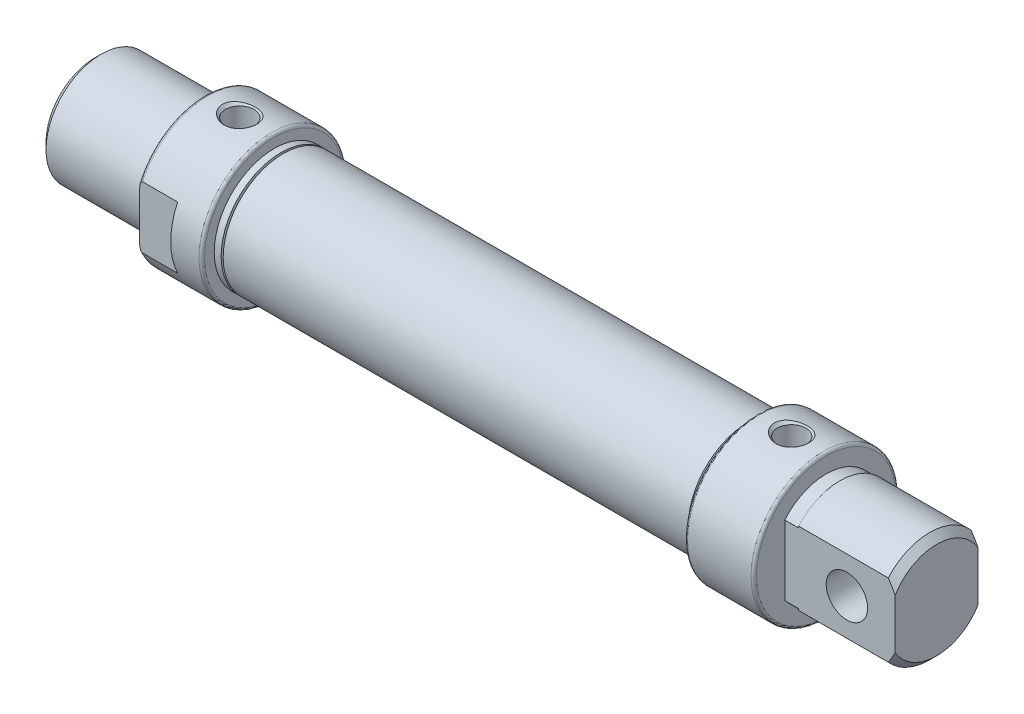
ISO-10303-21;
HEADER;
FILE_DESCRIPTION(('STEP AP214'),'2;1');
FILE_NAME('part.step','',(''),(''),'','','');
FILE_SCHEMA(('AUTOMOTIVE_DESIGN { 1 0 10303 214 1 1 1 1 }'));
ENDSEC;
DATA;
#1=APPLICATION_CONTEXT('core data for automotive mechanical design processes');
#2=APPLICATION_PROTOCOL_DEFINITION('international standard','automotive_design',2000,#1);
#3=PRODUCT_CONTEXT('',#1,'mechanical');
#4=PRODUCT('Part','Part','',(#3));
#5=PRODUCT_RELATED_PRODUCT_CATEGORY('part','',(#4));
#6=PRODUCT_DEFINITION_FORMATION('','',#4);
#7=PRODUCT_DEFINITION_CONTEXT('part definition',#1,'design');
#8=PRODUCT_DEFINITION('design','',#6,#7);
#9=PRODUCT_DEFINITION_SHAPE('','',#8);
#10=(LENGTH_UNIT() NAMED_UNIT(*) SI_UNIT(.MILLI.,.METRE.));
#11=(NAMED_UNIT(*) PLANE_ANGLE_UNIT() SI_UNIT($,.RADIAN.));
#12=(NAMED_UNIT(*) SI_UNIT($,.STERADIAN.) SOLID_ANGLE_UNIT());
#13=UNCERTAINTY_MEASURE_WITH_UNIT(LENGTH_MEASURE(1.E-05),#10,'distance_accuracy_value','');
#14=(GEOMETRIC_REPRESENTATION_CONTEXT(3) GLOBAL_UNCERTAINTY_ASSIGNED_CONTEXT((#13)) GLOBAL_UNIT_ASSIGNED_CONTEXT((#10,
#11,#12)) REPRESENTATION_CONTEXT('',''));
#15=CARTESIAN_POINT('',(0.,0.,0.));
#16=DIRECTION('',(0.,0.,1.));
#17=DIRECTION('',(1.,0.,0.));
#18=AXIS2_PLACEMENT_3D('',#15,#16,#17);
#19=CARTESIAN_POINT('',(86.,8.,0.));
#20=DIRECTION('',(-1.,0.,0.));
#21=DIRECTION('',(0.,0.,1.));
#22=AXIS2_PLACEMENT_3D('',#19,#20,#21);
#23=PLANE('',#22);
#24=CARTESIAN_POINT('',(86.,0.,0.));
#25=DIRECTION('',(-1.,0.,0.));
#26=DIRECTION('',(0.,0.,1.));
#27=AXIS2_PLACEMENT_3D('',#24,#25,#26);
#28=CIRCLE('',#27,8.);
#29=CARTESIAN_POINT('',(86.,0.,8.));
#30=VERTEX_POINT('',#29);
#31=EDGE_CURVE('E796',#30,#30,#28,.T.);
#32=ORIENTED_EDGE('',*,*,#31,.T.);
#33=EDGE_LOOP('',(#32));
#34=FACE_BOUND('',#33,.T.);
#35=ADVANCED_FACE('F17',(#34),#23,.T.);
#36=CARTESIAN_POINT('',(86.,0.,0.));
#37=DIRECTION('',(-1.,0.,0.));
#38=DIRECTION('',(0.,0.,1.));
#39=AXIS2_PLACEMENT_3D('',#36,#37,#38);
#40=CYLINDRICAL_SURFACE('',#39,8.);
#41=CARTESIAN_POINT('',(36.,0.,0.));
#42=DIRECTION('',(-1.,0.,0.));
#43=DIRECTION('',(0.,0.,1.));
#44=AXIS2_PLACEMENT_3D('',#41,#42,#43);
#45=CIRCLE('',#44,8.);
#46=CARTESIAN_POINT('',(36.,0.,8.));
#47=VERTEX_POINT('',#46);
#48=EDGE_CURVE('E794',#47,#47,#45,.F.);
#49=ORIENTED_EDGE('',*,*,#48,.F.);
#50=EDGE_LOOP('',(#49));
#51=FACE_BOUND('',#50,.T.);
#52=ORIENTED_EDGE('',*,*,#31,.F.);
#53=EDGE_LOOP('',(#52));
#54=FACE_BOUND('',#53,.T.);
#55=ADVANCED_FACE('F496',(#51,#54),#40,.F.);
#56=CARTESIAN_POINT('',(36.,3.,0.));
#57=DIRECTION('',(1.,0.,0.));
#58=DIRECTION('',(0.,0.,-1.));
#59=AXIS2_PLACEMENT_3D('',#56,#57,#58);
#60=PLANE('',#59);
#61=ORIENTED_EDGE('',*,*,#48,.T.);
#62=EDGE_LOOP('',(#61));
#63=FACE_BOUND('',#62,.T.);
#64=CARTESIAN_POINT('',(36.,0.,0.));
#65=DIRECTION('',(-1.,0.,0.));
#66=DIRECTION('',(0.,0.,1.));
#67=AXIS2_PLACEMENT_3D('',#64,#65,#66);
#68=CIRCLE('',#67,3.);
#69=CARTESIAN_POINT('',(36.,0.,3.));
#70=VERTEX_POINT('',#69);
#71=EDGE_CURVE('E791',#70,#70,#68,.T.);
#72=ORIENTED_EDGE('',*,*,#71,.T.);
#73=EDGE_LOOP('',(#72));
#74=FACE_BOUND('',#73,.T.);
#75=ADVANCED_FACE('F493',(#63,#74),#60,.T.);
#76=CARTESIAN_POINT('',(86.,0.,0.));
#77=DIRECTION('',(-1.,0.,0.));
#78=DIRECTION('',(0.,0.,1.));
#79=AXIS2_PLACEMENT_3D('',#76,#77,#78);
#80=CYLINDRICAL_SURFACE('',#79,3.);
#81=ORIENTED_EDGE('',*,*,#71,.F.);
#82=EDGE_LOOP('',(#81));
#83=FACE_BOUND('',#82,.T.);
#84=CARTESIAN_POINT('',(0.,0.,0.));
#85=DIRECTION('',(-1.,0.,0.));
#86=DIRECTION('',(0.,0.,1.));
#87=AXIS2_PLACEMENT_3D('',#84,#85,#86);
#88=CIRCLE('',#87,3.);
#89=CARTESIAN_POINT('',(0.,0.,3.));
#90=VERTEX_POINT('',#89);
#91=EDGE_CURVE('E205',#90,#90,#88,.T.);
#92=ORIENTED_EDGE('',*,*,#91,.T.);
#93=EDGE_LOOP('',(#92));
#94=FACE_BOUND('',#93,.T.);
#95=ADVANCED_FACE('F489',(#83,#94),#80,.F.);
#96=CARTESIAN_POINT('',(0.,0.,0.));
#97=DIRECTION('',(1.,0.,0.));
#98=DIRECTION('',(0.,0.,-1.));
#99=AXIS2_PLACEMENT_3D('',#96,#97,#98);
#100=PLANE('',#99);
#101=ORIENTED_EDGE('',*,*,#91,.F.);
#102=EDGE_LOOP('',(#101));
#103=FACE_BOUND('',#102,.T.);
#104=CARTESIAN_POINT('',(0.,0.,0.));
#105=DIRECTION('',(1.,0.,0.));
#106=DIRECTION('',(0.,0.,-1.));
#107=AXIS2_PLACEMENT_3D('',#104,#105,#106);
#108=CIRCLE('',#107,7.08);
#109=CARTESIAN_POINT('',(0.,0.,-7.08));
#110=VERTEX_POINT('',#109);
#111=EDGE_CURVE('E203',#110,#110,#108,.T.);
#112=ORIENTED_EDGE('',*,*,#111,.F.);
#113=EDGE_LOOP('',(#112));
#114=FACE_BOUND('',#113,.T.);
#115=ADVANCED_FACE('F485',(#103,#114),#100,.F.);
#116=CARTESIAN_POINT('',(108.,7.85,0.));
#117=DIRECTION('',(1.,0.,0.));
#118=DIRECTION('',(0.,0.,-1.));
#119=AXIS2_PLACEMENT_3D('',#116,#117,#118);
#120=PLANE('',#119);
#121=CARTESIAN_POINT('',(108.,0.,0.));
#122=DIRECTION('',(-1.,0.,0.));
#123=DIRECTION('',(0.,0.,1.));
#124=AXIS2_PLACEMENT_3D('',#121,#122,#123);
#125=CIRCLE('',#124,8.);
#126=CARTESIAN_POINT('',(108.,5.29150262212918,-6.));
#127=VERTEX_POINT('',#126);
#128=CARTESIAN_POINT('',(108.,5.29150262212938,6.));
#129=VERTEX_POINT('',#128);
#130=EDGE_CURVE('E198',#127,#129,#125,.F.);
#131=ORIENTED_EDGE('',*,*,#130,.F.);
#132=DIRECTION('',(0.,1.,0.));
#133=VECTOR('',#132,1.);
#134=CARTESIAN_POINT('',(108.,-8.,-6.));
#135=LINE('',#134,#133);
#136=CARTESIAN_POINT('',(108.,5.06186724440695,-6.));
#137=VERTEX_POINT('',#136);
#138=EDGE_CURVE('E181',#137,#127,#135,.T.);
#139=ORIENTED_EDGE('',*,*,#138,.F.);
#140=CARTESIAN_POINT('',(108.,0.,0.));
#141=DIRECTION('',(-1.,0.,0.));
#142=DIRECTION('',(0.,0.,1.));
#143=AXIS2_PLACEMENT_3D('',#140,#141,#142);
#144=CIRCLE('',#143,7.85);
#145=CARTESIAN_POINT('',(108.,5.06186724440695,6.));
#146=VERTEX_POINT('',#145);
#147=EDGE_CURVE('E444',#146,#137,#144,.T.);
#148=ORIENTED_EDGE('',*,*,#147,.F.);
#149=DIRECTION('',(0.,1.,0.));
#150=VECTOR('',#149,1.);
#151=CARTESIAN_POINT('',(108.,7.85,6.));
#152=LINE('',#151,#150);
#153=EDGE_CURVE('E200',#129,#146,#152,.F.);
#154=ORIENTED_EDGE('',*,*,#153,.F.);
#155=EDGE_LOOP('',(#131,#139,#148,#154));
#156=FACE_BOUND('',#155,.T.);
#157=ADVANCED_FACE('F481',(#156),#120,.F.);
#158=CARTESIAN_POINT('',(122.,0.,0.));
#159=DIRECTION('',(-1.,0.,0.));
#160=DIRECTION('',(0.,0.,1.));
#161=AXIS2_PLACEMENT_3D('',#158,#159,#160);
#162=CYLINDRICAL_SURFACE('',#161,8.);
#163=DIRECTION('',(1.,0.,0.));
#164=VECTOR('',#163,1.);
#165=CARTESIAN_POINT('',(106.,-5.29150262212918,6.));
#166=LINE('',#165,#164);
#167=CARTESIAN_POINT('',(108.,-5.29150262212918,6.));
#168=VERTEX_POINT('',#167);
#169=CARTESIAN_POINT('',(121.,-5.29150262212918,6.));
#170=VERTEX_POINT('',#169);
#171=EDGE_CURVE('E193',#168,#170,#166,.T.);
#172=ORIENTED_EDGE('',*,*,#171,.F.);
#173=CARTESIAN_POINT('',(108.,0.,0.));
#174=DIRECTION('',(-1.,0.,0.));
#175=DIRECTION('',(0.,0.,1.));
#176=AXIS2_PLACEMENT_3D('',#173,#174,#175);
#177=CIRCLE('',#176,8.);
#178=CARTESIAN_POINT('',(108.,-5.29150262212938,-6.));
#179=VERTEX_POINT('',#178);
#180=EDGE_CURVE('E197',#168,#179,#177,.F.);
#181=ORIENTED_EDGE('',*,*,#180,.T.);
#182=DIRECTION('',(-1.,0.,0.));
#183=VECTOR('',#182,1.);
#184=CARTESIAN_POINT('',(106.,-5.29150262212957,-6.));
#185=LINE('',#184,#183);
#186=CARTESIAN_POINT('',(121.,-5.29150262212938,-6.));
#187=VERTEX_POINT('',#186);
#188=EDGE_CURVE('E168',#187,#179,#185,.T.);
#189=ORIENTED_EDGE('',*,*,#188,.F.);
#190=CARTESIAN_POINT('',(121.,0.,0.));
#191=DIRECTION('',(-1.,0.,0.));
#192=DIRECTION('',(0.,0.,1.));
#193=AXIS2_PLACEMENT_3D('',#190,#191,#192);
#194=CIRCLE('',#193,8.);
#195=EDGE_CURVE('E160',#170,#187,#194,.F.);
#196=ORIENTED_EDGE('',*,*,#195,.F.);
#197=EDGE_LOOP('',(#172,#181,#189,#196));
#198=FACE_BOUND('',#197,.T.);
#199=ADVANCED_FACE('F477',(#198),#162,.T.);
#200=CARTESIAN_POINT('',(121.,0.,0.));
#201=DIRECTION('',(-1.,0.,0.));
#202=DIRECTION('',(0.,0.,1.));
#203=AXIS2_PLACEMENT_3D('',#200,#201,#202);
#204=CONICAL_SURFACE('',#203,8.00000000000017,0.78539816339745);
#205=CARTESIAN_POINT('',(122.,-3.60555127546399,-6.));
#206=CARTESIAN_POINT('',(121.925105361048,-3.7509099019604,-6.));
#207=CARTESIAN_POINT('',(121.847630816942,-3.89491061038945,-6.));
#208=CARTESIAN_POINT('',(121.688292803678,-4.18032965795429,-6.));
#209=CARTESIAN_POINT('',(121.606432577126,-4.32174980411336,-6.));
#210=CARTESIAN_POINT('',(121.438995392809,-4.60233135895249,-6.));
#211=CARTESIAN_POINT('',(121.353418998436,-4.74149310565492,-6.));
#212=CARTESIAN_POINT('',(121.179007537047,-5.01790384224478,-6.));
#213=CARTESIAN_POINT('',(121.090170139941,-5.15515136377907,-6.));
#214=CARTESIAN_POINT('',(121.,-5.29150262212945,-6.));
#215=B_SPLINE_CURVE_WITH_KNOTS('',3,(#205,#206,#207,#208,#209,#210,#211,#212,#213,#214),
.UNSPECIFIED.,.F.,.F.,(4,2,2,2,4),(0.,0.490493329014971,0.980628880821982,1.47069038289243,
1.96110913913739),.UNSPECIFIED.);
#216=CARTESIAN_POINT('',(122.,-3.60555127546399,-6.));
#217=VERTEX_POINT('',#216);
#218=EDGE_CURVE('E163',#217,#187,#215,.T.);
#219=ORIENTED_EDGE('',*,*,#218,.F.);
#220=CARTESIAN_POINT('',(122.,0.,0.));
#221=DIRECTION('',(-1.,0.,0.));
#222=DIRECTION('',(0.,0.,1.));
#223=AXIS2_PLACEMENT_3D('',#220,#221,#222);
#224=CIRCLE('',#223,7.);
#225=CARTESIAN_POINT('',(122.,-3.60555127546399,6.));
#226=VERTEX_POINT('',#225);
#227=EDGE_CURVE('E148',#217,#226,#224,.T.);
#228=ORIENTED_EDGE('',*,*,#227,.T.);
#229=CARTESIAN_POINT('',(121.,-5.29150262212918,6.));
#230=CARTESIAN_POINT('',(121.090170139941,-5.15515136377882,6.));
#231=CARTESIAN_POINT('',(121.179007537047,-5.01790384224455,6.));
#232=CARTESIAN_POINT('',(121.353418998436,-4.74149310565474,6.));
#233=CARTESIAN_POINT('',(121.438995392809,-4.60233135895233,6.));
#234=CARTESIAN_POINT('',(121.606432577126,-4.32174980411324,6.));
#235=CARTESIAN_POINT('',(121.688292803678,-4.1803296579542,6.));
#236=CARTESIAN_POINT('',(121.847630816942,-3.89491061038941,6.));
#237=CARTESIAN_POINT('',(121.925105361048,-3.75090990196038,6.));
#238=CARTESIAN_POINT('',(122.,-3.60555127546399,6.));
#239=B_SPLINE_CURVE_WITH_KNOTS('',3,(#229,#230,#231,#232,#233,#234,#235,#236,#237,#238),
.UNSPECIFIED.,.F.,.F.,(4,2,2,2,4),(0.,0.490418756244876,0.980480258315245,1.47061581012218,
1.96110913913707),.UNSPECIFIED.);
#240=EDGE_CURVE('E439',#170,#226,#239,.T.);
#241=ORIENTED_EDGE('',*,*,#240,.F.);
#242=ORIENTED_EDGE('',*,*,#195,.T.);
#243=EDGE_LOOP('',(#219,#228,#241,#242));
#244=FACE_BOUND('',#243,.T.);
#245=ADVANCED_FACE('F164',(#244),#204,.T.);
#246=CARTESIAN_POINT('',(122.,7.,0.));
#247=DIRECTION('',(-1.,0.,0.));
#248=DIRECTION('',(0.,0.,1.));
#249=AXIS2_PLACEMENT_3D('',#246,#247,#248);
#250=PLANE('',#249);
#251=ORIENTED_EDGE('',*,*,#227,.F.);
#252=DIRECTION('',(0.,1.,0.));
#253=VECTOR('',#252,1.);
#254=CARTESIAN_POINT('',(122.,-8.,-6.));
#255=LINE('',#254,#253);
#256=CARTESIAN_POINT('',(122.,3.60555127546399,-6.));
#257=VERTEX_POINT('',#256);
#258=EDGE_CURVE('E152',#257,#217,#255,.F.);
#259=ORIENTED_EDGE('',*,*,#258,.F.);
#260=CARTESIAN_POINT('',(122.,0.,0.));
#261=DIRECTION('',(-1.,0.,0.));
#262=DIRECTION('',(0.,0.,1.));
#263=AXIS2_PLACEMENT_3D('',#260,#261,#262);
#264=CIRCLE('',#263,7.);
#265=CARTESIAN_POINT('',(122.,3.60555127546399,6.));
#266=VERTEX_POINT('',#265);
#267=EDGE_CURVE('E159',#266,#257,#264,.T.);
#268=ORIENTED_EDGE('',*,*,#267,.F.);
#269=DIRECTION('',(0.,1.,0.));
#270=VECTOR('',#269,1.);
#271=CARTESIAN_POINT('',(122.,8.,6.));
#272=LINE('',#271,#270);
#273=EDGE_CURVE('E155',#226,#266,#272,.T.);
#274=ORIENTED_EDGE('',*,*,#273,.F.);
#275=EDGE_LOOP('',(#251,#259,#268,#274));
#276=FACE_BOUND('',#275,.T.);
#277=ADVANCED_FACE('F150',(#276),#250,.F.);
#278=CARTESIAN_POINT('',(121.,0.,0.));
#279=DIRECTION('',(-1.,0.,0.));
#280=DIRECTION('',(0.,0.,1.));
#281=AXIS2_PLACEMENT_3D('',#278,#279,#280);
#282=CONICAL_SURFACE('',#281,8.00000000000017,0.78539816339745);
#283=CARTESIAN_POINT('',(121.,5.2915026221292,-6.));
#284=CARTESIAN_POINT('',(121.090170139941,5.15515136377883,-6.));
#285=CARTESIAN_POINT('',(121.179007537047,5.01790384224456,-6.));
#286=CARTESIAN_POINT('',(121.353418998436,4.74149310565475,-6.));
#287=CARTESIAN_POINT('',(121.438995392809,4.60233135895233,-6.));
#288=CARTESIAN_POINT('',(121.606432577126,4.32174980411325,-6.));
#289=CARTESIAN_POINT('',(121.688292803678,4.1803296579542,-6.));
#290=CARTESIAN_POINT('',(121.847630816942,3.89491061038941,-6.));
#291=CARTESIAN_POINT('',(121.925105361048,3.75090990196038,-6.));
#292=CARTESIAN_POINT('',(122.,3.60555127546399,-6.));
#293=B_SPLINE_CURVE_WITH_KNOTS('',3,(#283,#284,#285,#286,#287,#288,#289,#290,#291,#292),
.UNSPECIFIED.,.F.,.F.,(4,2,2,2,4),(0.,0.490418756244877,0.980480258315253,1.47061581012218,
1.96110913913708),.UNSPECIFIED.);
#294=CARTESIAN_POINT('',(121.,5.29150262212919,-6.));
#295=VERTEX_POINT('',#294);
#296=EDGE_CURVE('E173',#295,#257,#293,.T.);
#297=ORIENTED_EDGE('',*,*,#296,.F.);
#298=CARTESIAN_POINT('',(121.,0.,0.));
#299=DIRECTION('',(-1.,0.,0.));
#300=DIRECTION('',(0.,0.,1.));
#301=AXIS2_PLACEMENT_3D('',#298,#299,#300);
#302=CIRCLE('',#301,8.);
#303=CARTESIAN_POINT('',(121.,5.29150262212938,6.));
#304=VERTEX_POINT('',#303);
#305=EDGE_CURVE('E195',#304,#295,#302,.T.);
#306=ORIENTED_EDGE('',*,*,#305,.F.);
#307=CARTESIAN_POINT('',(122.,3.60555127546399,6.));
#308=CARTESIAN_POINT('',(121.925105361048,3.7509099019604,6.));
#309=CARTESIAN_POINT('',(121.847630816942,3.89491061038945,6.));
#310=CARTESIAN_POINT('',(121.688292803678,4.18032965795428,6.));
#311=CARTESIAN_POINT('',(121.606432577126,4.32174980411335,6.));
#312=CARTESIAN_POINT('',(121.438995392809,4.60233135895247,6.));
#313=CARTESIAN_POINT('',(121.353418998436,4.74149310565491,6.));
#314=CARTESIAN_POINT('',(121.179007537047,5.01790384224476,6.));
#315=CARTESIAN_POINT('',(121.090170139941,5.15515136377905,6.));
#316=CARTESIAN_POINT('',(121.,5.29150262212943,6.));
#317=B_SPLINE_CURVE_WITH_KNOTS('',3,(#307,#308,#309,#310,#311,#312,#313,#314,#315,#316),
.UNSPECIFIED.,.F.,.F.,(4,2,2,2,4),(0.,0.490493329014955,0.980628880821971,1.47069038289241,
1.96110913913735),.UNSPECIFIED.);
#318=EDGE_CURVE('E437',#266,#304,#317,.T.);
#319=ORIENTED_EDGE('',*,*,#318,.F.);
#320=ORIENTED_EDGE('',*,*,#267,.T.);
#321=EDGE_LOOP('',(#297,#306,#319,#320));
#322=FACE_BOUND('',#321,.T.);
#323=ADVANCED_FACE('F643',(#322),#282,.T.);
#324=CARTESIAN_POINT('',(122.,0.,0.));
#325=DIRECTION('',(-1.,0.,0.));
#326=DIRECTION('',(0.,0.,1.));
#327=AXIS2_PLACEMENT_3D('',#324,#325,#326);
#328=CYLINDRICAL_SURFACE('',#327,8.);
#329=DIRECTION('',(1.,0.,0.));
#330=VECTOR('',#329,1.);
#331=CARTESIAN_POINT('',(106.,5.29150262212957,6.));
#332=LINE('',#331,#330);
#333=EDGE_CURVE('E433',#304,#129,#332,.F.);
#334=ORIENTED_EDGE('',*,*,#333,.F.);
#335=ORIENTED_EDGE('',*,*,#305,.T.);
#336=DIRECTION('',(-1.,0.,0.));
#337=VECTOR('',#336,1.);
#338=CARTESIAN_POINT('',(106.,5.29150262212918,-6.));
#339=LINE('',#338,#337);
#340=EDGE_CURVE('E175',#127,#295,#339,.F.);
#341=ORIENTED_EDGE('',*,*,#340,.F.);
#342=ORIENTED_EDGE('',*,*,#130,.T.);
#343=EDGE_LOOP('',(#334,#335,#341,#342));
#344=FACE_BOUND('',#343,.T.);
#345=ADVANCED_FACE('F647',(#344),#328,.T.);
#346=CARTESIAN_POINT('',(115.,0.,-6.));
#347=DIRECTION('',(0.,0.,1.));
#348=DIRECTION('',(1.,0.,0.));
#349=AXIS2_PLACEMENT_3D('',#346,#347,#348);
#350=CYLINDRICAL_SURFACE('',#349,3.);
#351=CARTESIAN_POINT('',(115.,0.,6.));
#352=DIRECTION('',(0.,0.,1.));
#353=DIRECTION('',(1.,0.,0.));
#354=AXIS2_PLACEMENT_3D('',#351,#352,#353);
#355=CIRCLE('',#354,3.);
#356=CARTESIAN_POINT('',(118.,0.,6.));
#357=VERTEX_POINT('',#356);
#358=EDGE_CURVE('E430',#357,#357,#355,.F.);
#359=ORIENTED_EDGE('',*,*,#358,.F.);
#360=EDGE_LOOP('',(#359));
#361=FACE_BOUND('',#360,.T.);
#362=CARTESIAN_POINT('',(115.,0.,-6.));
#363=DIRECTION('',(0.,0.,1.));
#364=DIRECTION('',(1.,0.,0.));
#365=AXIS2_PLACEMENT_3D('',#362,#363,#364);
#366=CIRCLE('',#365,3.);
#367=CARTESIAN_POINT('',(118.,0.,-6.));
#368=VERTEX_POINT('',#367);
#369=EDGE_CURVE('E189',#368,#368,#366,.T.);
#370=ORIENTED_EDGE('',*,*,#369,.F.);
#371=EDGE_LOOP('',(#370));
#372=FACE_BOUND('',#371,.T.);
#373=ADVANCED_FACE('F652',(#361,#372),#350,.F.);
#374=CARTESIAN_POINT('',(108.,7.85,0.));
#375=DIRECTION('',(1.,0.,0.));
#376=DIRECTION('',(0.,0.,-1.));
#377=AXIS2_PLACEMENT_3D('',#374,#375,#376);
#378=PLANE('',#377);
#379=CARTESIAN_POINT('',(108.,0.,0.));
#380=DIRECTION('',(-1.,0.,0.));
#381=DIRECTION('',(0.,0.,1.));
#382=AXIS2_PLACEMENT_3D('',#379,#380,#381);
#383=CIRCLE('',#382,7.85);
#384=CARTESIAN_POINT('',(108.,-5.06186724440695,-6.));
#385=VERTEX_POINT('',#384);
#386=CARTESIAN_POINT('',(108.,-5.06186724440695,6.));
#387=VERTEX_POINT('',#386);
#388=EDGE_CURVE('E186',#385,#387,#383,.T.);
#389=ORIENTED_EDGE('',*,*,#388,.F.);
#390=DIRECTION('',(0.,1.,0.));
#391=VECTOR('',#390,1.);
#392=CARTESIAN_POINT('',(108.,-8.,-6.));
#393=LINE('',#392,#391);
#394=EDGE_CURVE('E187',#179,#385,#393,.T.);
#395=ORIENTED_EDGE('',*,*,#394,.F.);
#396=ORIENTED_EDGE('',*,*,#180,.F.);
#397=DIRECTION('',(0.,1.,0.));
#398=VECTOR('',#397,1.);
#399=CARTESIAN_POINT('',(108.,8.,6.));
#400=LINE('',#399,#398);
#401=EDGE_CURVE('E190',#387,#168,#400,.F.);
#402=ORIENTED_EDGE('',*,*,#401,.F.);
#403=EDGE_LOOP('',(#389,#395,#396,#402));
#404=FACE_BOUND('',#403,.T.);
#405=ADVANCED_FACE('F656',(#404),#378,.F.);
#406=CARTESIAN_POINT('',(0.920000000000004,0.,0.));
#407=DIRECTION('',(1.,0.,0.));
#408=DIRECTION('',(0.,0.,-1.));
#409=AXIS2_PLACEMENT_3D('',#406,#407,#408);
#410=CONICAL_SURFACE('',#409,8.,0.785398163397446);
#411=CARTESIAN_POINT('',(0.920000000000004,0.,0.));
#412=DIRECTION('',(-1.,0.,0.));
#413=DIRECTION('',(0.,0.,1.));
#414=AXIS2_PLACEMENT_3D('',#411,#412,#413);
#415=CIRCLE('',#414,8.);
#416=CARTESIAN_POINT('',(0.920000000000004,0.,8.));
#417=VERTEX_POINT('',#416);
#418=EDGE_CURVE('E182',#417,#417,#415,.F.);
#419=ORIENTED_EDGE('',*,*,#418,.F.);
#420=EDGE_LOOP('',(#419));
#421=FACE_BOUND('',#420,.T.);
#422=ORIENTED_EDGE('',*,*,#111,.T.);
#423=EDGE_LOOP('',(#422));
#424=FACE_BOUND('',#423,.T.);
#425=ADVANCED_FACE('F660',(#421,#424),#410,.T.);
#426=CARTESIAN_POINT('',(103.067,3.75,0.));
#427=DIRECTION('',(0.,1.,0.));
#428=DIRECTION('',(0.,0.,1.));
#429=AXIS2_PLACEMENT_3D('',#426,#427,#428);
#430=PLANE('',#429);
#431=CARTESIAN_POINT('',(101.,3.75,0.));
#432=DIRECTION('',(0.,1.,0.));
#433=DIRECTION('',(0.,0.,1.));
#434=AXIS2_PLACEMENT_3D('',#431,#432,#433);
#435=CIRCLE('',#434,2.067);
#436=CARTESIAN_POINT('',(101.,3.75,2.067));
#437=VERTEX_POINT('',#436);
#438=EDGE_CURVE('E185',#437,#437,#435,.T.);
#439=ORIENTED_EDGE('',*,*,#438,.T.);
#440=EDGE_LOOP('',(#439));
#441=FACE_BOUND('',#440,.T.);
#442=ADVANCED_FACE('F663',(#441),#430,.T.);
#443=CARTESIAN_POINT('',(106.,-8.,-6.));
#444=DIRECTION('',(0.,0.,-1.));
#445=DIRECTION('',(-1.,0.,0.));
#446=AXIS2_PLACEMENT_3D('',#443,#444,#445);
#447=PLANE('',#446);
#448=ORIENTED_EDGE('',*,*,#369,.T.);
#449=EDGE_LOOP('',(#448));
#450=FACE_BOUND('',#449,.T.);
#451=DIRECTION('',(-1.,0.,0.));
#452=VECTOR('',#451,1.);
#453=CARTESIAN_POINT('',(122.,-5.06186724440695,-6.));
#454=LINE('',#453,#452);
#455=CARTESIAN_POINT('',(106.,-5.06186724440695,-6.));
#456=VERTEX_POINT('',#455);
#457=EDGE_CURVE('E429',#456,#385,#454,.F.);
#458=ORIENTED_EDGE('',*,*,#457,.F.);
#459=DIRECTION('',(0.,1.,0.));
#460=VECTOR('',#459,1.);
#461=CARTESIAN_POINT('',(106.,10.1,-6.));
#462=LINE('',#461,#460);
#463=CARTESIAN_POINT('',(106.,5.06186724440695,-6.));
#464=VERTEX_POINT('',#463);
#465=EDGE_CURVE('E410',#456,#464,#462,.T.);
#466=ORIENTED_EDGE('',*,*,#465,.T.);
#467=DIRECTION('',(-1.,0.,0.));
#468=VECTOR('',#467,1.);
#469=CARTESIAN_POINT('',(122.,5.06186724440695,-6.));
#470=LINE('',#469,#468);
#471=EDGE_CURVE('E194',#137,#464,#470,.T.);
#472=ORIENTED_EDGE('',*,*,#471,.F.);
#473=ORIENTED_EDGE('',*,*,#138,.T.);
#474=ORIENTED_EDGE('',*,*,#340,.T.);
#475=ORIENTED_EDGE('',*,*,#296,.T.);
#476=ORIENTED_EDGE('',*,*,#258,.T.);
#477=ORIENTED_EDGE('',*,*,#218,.T.);
#478=ORIENTED_EDGE('',*,*,#188,.T.);
#479=ORIENTED_EDGE('',*,*,#394,.T.);
#480=EDGE_LOOP('',(#458,#466,#472,#473,#474,#475,#476,#477,#478,#479));
#481=FACE_BOUND('',#480,.T.);
#482=ADVANCED_FACE('F170',(#450,#481),#447,.T.);
#483=CARTESIAN_POINT('',(122.,0.,0.));
#484=DIRECTION('',(-1.,0.,0.));
#485=DIRECTION('',(0.,0.,1.));
#486=AXIS2_PLACEMENT_3D('',#483,#484,#485);
#487=CYLINDRICAL_SURFACE('',#486,7.85);
#488=ORIENTED_EDGE('',*,*,#471,.T.);
#489=CARTESIAN_POINT('',(106.,0.,0.));
#490=DIRECTION('',(-1.,0.,0.));
#491=DIRECTION('',(0.,0.,1.));
#492=AXIS2_PLACEMENT_3D('',#489,#490,#491);
#493=CIRCLE('',#492,7.85);
#494=CARTESIAN_POINT('',(106.,5.06186724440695,6.));
#495=VERTEX_POINT('',#494);
#496=EDGE_CURVE('E409',#464,#495,#493,.F.);
#497=ORIENTED_EDGE('',*,*,#496,.T.);
#498=DIRECTION('',(1.,0.,0.));
#499=VECTOR('',#498,1.);
#500=CARTESIAN_POINT('',(106.,5.06186724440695,6.));
#501=LINE('',#500,#499);
#502=EDGE_CURVE('E436',#146,#495,#501,.F.);
#503=ORIENTED_EDGE('',*,*,#502,.F.);
#504=ORIENTED_EDGE('',*,*,#147,.T.);
#505=EDGE_LOOP('',(#488,#497,#503,#504));
#506=FACE_BOUND('',#505,.T.);
#507=ADVANCED_FACE('F670',(#506),#487,.T.);
#508=CARTESIAN_POINT('',(106.,8.,6.));
#509=DIRECTION('',(0.,0.,1.));
#510=DIRECTION('',(1.,0.,0.));
#511=AXIS2_PLACEMENT_3D('',#508,#509,#510);
#512=PLANE('',#511);
#513=ORIENTED_EDGE('',*,*,#358,.T.);
#514=EDGE_LOOP('',(#513));
#515=FACE_BOUND('',#514,.T.);
#516=ORIENTED_EDGE('',*,*,#502,.T.);
#517=DIRECTION('',(0.,1.,0.));
#518=VECTOR('',#517,1.);
#519=CARTESIAN_POINT('',(106.,10.1,6.));
#520=LINE('',#519,#518);
#521=CARTESIAN_POINT('',(106.,-5.06186724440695,6.));
#522=VERTEX_POINT('',#521);
#523=EDGE_CURVE('E401',#495,#522,#520,.F.);
#524=ORIENTED_EDGE('',*,*,#523,.T.);
#525=DIRECTION('',(-1.,0.,0.));
#526=VECTOR('',#525,1.);
#527=CARTESIAN_POINT('',(122.,-5.06186724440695,6.));
#528=LINE('',#527,#526);
#529=EDGE_CURVE('E426',#387,#522,#528,.T.);
#530=ORIENTED_EDGE('',*,*,#529,.F.);
#531=ORIENTED_EDGE('',*,*,#401,.T.);
#532=ORIENTED_EDGE('',*,*,#171,.T.);
#533=ORIENTED_EDGE('',*,*,#240,.T.);
#534=ORIENTED_EDGE('',*,*,#273,.T.);
#535=ORIENTED_EDGE('',*,*,#318,.T.);
#536=ORIENTED_EDGE('',*,*,#333,.T.);
#537=ORIENTED_EDGE('',*,*,#153,.T.);
#538=EDGE_LOOP('',(#516,#524,#530,#531,#532,#533,#534,#535,#536,#537));
#539=FACE_BOUND('',#538,.T.);
#540=ADVANCED_FACE('F640',(#515,#539),#512,.T.);
#541=CARTESIAN_POINT('',(122.,0.,0.));
#542=DIRECTION('',(-1.,0.,0.));
#543=DIRECTION('',(0.,0.,1.));
#544=AXIS2_PLACEMENT_3D('',#541,#542,#543);
#545=CYLINDRICAL_SURFACE('',#544,7.85);
#546=ORIENTED_EDGE('',*,*,#457,.T.);
#547=ORIENTED_EDGE('',*,*,#388,.T.);
#548=ORIENTED_EDGE('',*,*,#529,.T.);
#549=CARTESIAN_POINT('',(106.,0.,0.));
#550=DIRECTION('',(-1.,0.,0.));
#551=DIRECTION('',(0.,0.,1.));
#552=AXIS2_PLACEMENT_3D('',#549,#550,#551);
#553=CIRCLE('',#552,7.85);
#554=EDGE_CURVE('E408',#522,#456,#553,.F.);
#555=ORIENTED_EDGE('',*,*,#554,.T.);
#556=EDGE_LOOP('',(#546,#547,#548,#555));
#557=FACE_BOUND('',#556,.T.);
#558=ADVANCED_FACE('F762',(#557),#545,.T.);
#559=CARTESIAN_POINT('',(23.067,3.75,0.));
#560=DIRECTION('',(0.,1.,0.));
#561=DIRECTION('',(0.,0.,1.));
#562=AXIS2_PLACEMENT_3D('',#559,#560,#561);
#563=PLANE('',#562);
#564=CARTESIAN_POINT('',(21.,3.75,0.));
#565=DIRECTION('',(0.,1.,0.));
#566=DIRECTION('',(0.,0.,1.));
#567=AXIS2_PLACEMENT_3D('',#564,#565,#566);
#568=CIRCLE('',#567,2.067);
#569=CARTESIAN_POINT('',(21.,3.75,2.067));
#570=VERTEX_POINT('',#569);
#571=EDGE_CURVE('E615',#570,#570,#568,.T.);
#572=ORIENTED_EDGE('',*,*,#571,.T.);
#573=EDGE_LOOP('',(#572));
#574=FACE_BOUND('',#573,.T.);
#575=ADVANCED_FACE('F680',(#574),#563,.T.);
#576=CARTESIAN_POINT('',(106.,0.,0.));
#577=DIRECTION('',(-1.,0.,0.));
#578=DIRECTION('',(0.,0.,1.));
#579=AXIS2_PLACEMENT_3D('',#576,#577,#578);
#580=CYLINDRICAL_SURFACE('',#579,8.);
#581=ORIENTED_EDGE('',*,*,#418,.T.);
#582=EDGE_LOOP('',(#581));
#583=FACE_BOUND('',#582,.T.);
#584=CARTESIAN_POINT('',(16.,0.,0.));
#585=DIRECTION('',(-1.,0.,0.));
#586=DIRECTION('',(0.,0.,1.));
#587=AXIS2_PLACEMENT_3D('',#584,#585,#586);
#588=CIRCLE('',#587,8.);
#589=CARTESIAN_POINT('',(16.,0.,8.));
#590=VERTEX_POINT('',#589);
#591=EDGE_CURVE('E613',#590,#590,#588,.T.);
#592=ORIENTED_EDGE('',*,*,#591,.T.);
#593=EDGE_LOOP('',(#592));
#594=FACE_BOUND('',#593,.T.);
#595=ADVANCED_FACE('F675',(#583,#594),#580,.T.);
#596=CARTESIAN_POINT('',(101.,3.75,0.));
#597=DIRECTION('',(0.,1.,0.));
#598=DIRECTION('',(0.,0.,1.));
#599=AXIS2_PLACEMENT_3D('',#596,#597,#598);
#600=CYLINDRICAL_SURFACE('',#599,2.067);
#601=CARTESIAN_POINT('',(101.,10.0669999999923,0.));
#602=DIRECTION('',(0.,1.,0.));
#603=DIRECTION('',(0.,0.,1.));
#604=AXIS2_PLACEMENT_3D('',#601,#602,#603);
#605=CIRCLE('',#604,2.06700000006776);
#606=CARTESIAN_POINT('',(101.,10.0669999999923,2.06700000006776));
#607=VERTEX_POINT('',#606);
#608=EDGE_CURVE('E418',#607,#607,#605,.T.);
#609=ORIENTED_EDGE('',*,*,#608,.T.);
#610=EDGE_LOOP('',(#609));
#611=FACE_BOUND('',#610,.T.);
#612=ORIENTED_EDGE('',*,*,#438,.F.);
#613=EDGE_LOOP('',(#612));
#614=FACE_BOUND('',#613,.T.);
#615=ADVANCED_FACE('F395',(#611,#614),#600,.F.);
#616=CARTESIAN_POINT('',(106.,10.1,0.));
#617=DIRECTION('',(-1.,0.,0.));
#618=DIRECTION('',(0.,0.,1.));
#619=AXIS2_PLACEMENT_3D('',#616,#617,#618);
#620=PLANE('',#619);
#621=CARTESIAN_POINT('',(106.,0.,0.));
#622=DIRECTION('',(-1.,0.,0.));
#623=DIRECTION('',(0.,0.,-1.));
#624=AXIS2_PLACEMENT_3D('',#621,#622,#623);
#625=CIRCLE('',#624,10.1);
#626=CARTESIAN_POINT('',(106.,0.,-10.1));
#627=VERTEX_POINT('',#626);
#628=CARTESIAN_POINT('',(106.,0.,10.1));
#629=VERTEX_POINT('',#628);
#630=EDGE_CURVE('E380',#627,#629,#625,.T.);
#631=ORIENTED_EDGE('',*,*,#630,.F.);
#632=CARTESIAN_POINT('',(106.,0.,0.));
#633=DIRECTION('',(-1.,0.,0.));
#634=DIRECTION('',(0.,0.,1.));
#635=AXIS2_PLACEMENT_3D('',#632,#633,#634);
#636=CIRCLE('',#635,10.1);
#637=EDGE_CURVE('E414',#629,#627,#636,.T.);
#638=ORIENTED_EDGE('',*,*,#637,.F.);
#639=EDGE_LOOP('',(#631,#638));
#640=FACE_BOUND('',#639,.T.);
#641=ORIENTED_EDGE('',*,*,#523,.F.);
#642=ORIENTED_EDGE('',*,*,#496,.F.);
#643=ORIENTED_EDGE('',*,*,#465,.F.);
#644=ORIENTED_EDGE('',*,*,#554,.F.);
#645=EDGE_LOOP('',(#641,#642,#643,#644));
#646=FACE_BOUND('',#645,.T.);
#647=ADVANCED_FACE('F386',(#640,#646),#620,.F.);
#648=CARTESIAN_POINT('',(21.,3.75,0.));
#649=DIRECTION('',(0.,1.,0.));
#650=DIRECTION('',(0.,0.,1.));
#651=AXIS2_PLACEMENT_3D('',#648,#649,#650);
#652=CYLINDRICAL_SURFACE('',#651,2.067);
#653=CARTESIAN_POINT('',(21.,10.0670000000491,0.));
#654=DIRECTION('',(0.,1.,0.));
#655=DIRECTION('',(0.,0.,1.));
#656=AXIS2_PLACEMENT_3D('',#653,#654,#655);
#657=CIRCLE('',#656,2.06700000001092);
#658=CARTESIAN_POINT('',(21.,10.0670000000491,2.06700000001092));
#659=VERTEX_POINT('',#658);
#660=EDGE_CURVE('E355',#659,#659,#657,.T.);
#661=ORIENTED_EDGE('',*,*,#660,.T.);
#662=EDGE_LOOP('',(#661));
#663=FACE_BOUND('',#662,.T.);
#664=ORIENTED_EDGE('',*,*,#571,.F.);
#665=EDGE_LOOP('',(#664));
#666=FACE_BOUND('',#665,.T.);
#667=ADVANCED_FACE('F336',(#663,#666),#652,.F.);
#668=CARTESIAN_POINT('',(16.,8.,0.));
#669=DIRECTION('',(1.,0.,0.));
#670=DIRECTION('',(0.,0.,-1.));
#671=AXIS2_PLACEMENT_3D('',#668,#669,#670);
#672=PLANE('',#671);
#673=DIRECTION('',(0.,1.,0.));
#674=VECTOR('',#673,1.);
#675=CARTESIAN_POINT('',(16.,10.5,9.5));
#676=LINE('',#675,#674);
#677=CARTESIAN_POINT('',(16.,-3.42928563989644,9.5));
#678=VERTEX_POINT('',#677);
#679=CARTESIAN_POINT('',(16.,3.42928563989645,9.5));
#680=VERTEX_POINT('',#679);
#681=EDGE_CURVE('E700',#678,#680,#676,.T.);
#682=ORIENTED_EDGE('',*,*,#681,.T.);
#683=CARTESIAN_POINT('',(16.,0.,0.));
#684=DIRECTION('',(1.,0.,0.));
#685=DIRECTION('',(0.,0.339533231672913,-0.940594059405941));
#686=AXIS2_PLACEMENT_3D('',#683,#684,#685);
#687=CIRCLE('',#686,10.1);
#688=CARTESIAN_POINT('',(16.,3.42928563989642,-9.5));
#689=VERTEX_POINT('',#688);
#690=EDGE_CURVE('E319',#689,#680,#687,.T.);
#691=ORIENTED_EDGE('',*,*,#690,.F.);
#692=DIRECTION('',(0.,1.,0.));
#693=VECTOR('',#692,1.);
#694=CARTESIAN_POINT('',(16.,-10.5,-9.5));
#695=LINE('',#694,#693);
#696=CARTESIAN_POINT('',(16.,-3.42928563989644,-9.5));
#697=VERTEX_POINT('',#696);
#698=EDGE_CURVE('E363',#689,#697,#695,.F.);
#699=ORIENTED_EDGE('',*,*,#698,.T.);
#700=CARTESIAN_POINT('',(16.,0.,0.));
#701=DIRECTION('',(1.,0.,0.));
#702=DIRECTION('',(0.,-0.339533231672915,0.940594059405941));
#703=AXIS2_PLACEMENT_3D('',#700,#701,#702);
#704=CIRCLE('',#703,10.1);
#705=EDGE_CURVE('E364',#678,#697,#704,.T.);
#706=ORIENTED_EDGE('',*,*,#705,.F.);
#707=EDGE_LOOP('',(#682,#691,#699,#706));
#708=FACE_BOUND('',#707,.T.);
#709=ORIENTED_EDGE('',*,*,#591,.F.);
#710=EDGE_LOOP('',(#709));
#711=FACE_BOUND('',#710,.T.);
#712=ADVANCED_FACE('F326',(#708,#711),#672,.F.);
#713=CARTESIAN_POINT('',(101.,10.5026217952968,0.));
#714=DIRECTION('',(0.,1.,0.));
#715=DIRECTION('',(0.,0.,1.));
#716=AXIS2_PLACEMENT_3D('',#713,#714,#715);
#717=CONICAL_SURFACE('',#716,2.50262179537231,0.785398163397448);
#718=CARTESIAN_POINT('',(101.,10.2549980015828,2.25499800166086));
#719=CARTESIAN_POINT('',(100.84955994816,10.255001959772,2.25499283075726));
#720=CARTESIAN_POINT('',(100.698926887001,10.257744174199,2.24261957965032));
#721=CARTESIAN_POINT('',(100.401697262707,10.2684060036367,2.19327478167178));
#722=CARTESIAN_POINT('',(100.255109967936,10.2763366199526,2.15625096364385));
#723=CARTESIAN_POINT('',(99.9707244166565,10.2964049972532,2.0582836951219));
#724=CARTESIAN_POINT('',(99.832910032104,10.3085347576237,1.99738570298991));
#725=CARTESIAN_POINT('',(99.5701721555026,10.33551487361,1.85270713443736));
#726=CARTESIAN_POINT('',(99.44524321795,10.3503640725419,1.76893627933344));
#727=CARTESIAN_POINT('',(99.2168156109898,10.3803436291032,1.58334215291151));
#728=CARTESIAN_POINT('',(99.1127216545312,10.3954461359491,1.48225007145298));
#729=CARTESIAN_POINT('',(98.9251131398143,10.4244359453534,1.26229182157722));
#730=CARTESIAN_POINT('',(98.8415854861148,10.4383240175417,1.14343704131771));
#731=CARTESIAN_POINT('',(98.7061390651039,10.4617286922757,0.903008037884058));
#732=CARTESIAN_POINT('',(98.6520036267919,10.4715316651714,0.782713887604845));
#733=CARTESIAN_POINT('',(98.5672867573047,10.4871562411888,0.533873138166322));
#734=CARTESIAN_POINT('',(98.5366824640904,10.4929817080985,0.405334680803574));
#735=CARTESIAN_POINT('',(98.502892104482,10.4994355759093,0.159127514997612));
#736=CARTESIAN_POINT('',(98.4970443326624,10.5005681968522,0.0418320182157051));
#737=CARTESIAN_POINT('',(98.5057466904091,10.4988952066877,-0.191954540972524));
#738=CARTESIAN_POINT('',(98.5202914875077,10.4960906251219,-0.308445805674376));
#739=CARTESIAN_POINT('',(98.5679258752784,10.4870832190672,-0.532052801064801));
#740=CARTESIAN_POINT('',(98.600177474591,10.4810342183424,-0.639355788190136));
#741=CARTESIAN_POINT('',(98.6811733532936,10.466275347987,-0.847325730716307));
#742=CARTESIAN_POINT('',(98.7299203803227,10.4575650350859,-0.947991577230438));
#743=CARTESIAN_POINT('',(98.8448606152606,10.4378325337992,-1.14542314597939));
#744=CARTESIAN_POINT('',(98.9118066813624,10.4267162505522,-1.24173950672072));
#745=CARTESIAN_POINT('',(99.05948068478,10.4035317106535,-1.42298747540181));
#746=CARTESIAN_POINT('',(99.1402128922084,10.3914631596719,-1.50791554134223));
#747=CARTESIAN_POINT('',(99.3220255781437,10.3661950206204,-1.67323135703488));
#748=CARTESIAN_POINT('',(99.4243439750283,10.3530064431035,-1.75225905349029));
#749=CARTESIAN_POINT('',(99.6400100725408,10.3280427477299,-1.89386277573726));
#750=CARTESIAN_POINT('',(99.7533669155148,10.3162688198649,-1.95642500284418));
#751=CARTESIAN_POINT('',(99.9996258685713,10.294221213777,-2.06945773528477));
#752=CARTESIAN_POINT('',(100.133357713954,10.2842031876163,-2.11817087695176));
#753=CARTESIAN_POINT('',(100.406868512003,10.2683053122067,-2.19395091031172));
#754=CARTESIAN_POINT('',(100.546637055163,10.2624186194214,-2.22105360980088));
#755=CARTESIAN_POINT('',(100.73941382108,10.2576031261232,-2.24312269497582));
#756=CARTESIAN_POINT('',(100.791420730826,10.2566282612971,-2.24757359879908));
#757=CARTESIAN_POINT('',(100.895610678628,10.2553250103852,-2.25351215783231));
#758=CARTESIAN_POINT('',(100.947793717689,10.2549966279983,-2.25499979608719));
#759=CARTESIAN_POINT('',(101.15044005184,10.2550019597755,-2.25499283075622));
#760=CARTESIAN_POINT('',(101.301073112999,10.2577441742,-2.24261957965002));
#761=CARTESIAN_POINT('',(101.598302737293,10.2684060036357,-2.19327478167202));
#762=CARTESIAN_POINT('',(101.744890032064,10.2763366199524,-2.1562509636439));
#763=CARTESIAN_POINT('',(102.029275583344,10.2964049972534,-2.05828369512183));
#764=CARTESIAN_POINT('',(102.167089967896,10.3085347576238,-1.99738570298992));
#765=CARTESIAN_POINT('',(102.429827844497,10.3355148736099,-1.8527071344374));
#766=CARTESIAN_POINT('',(102.55475678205,10.3503640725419,-1.76893627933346));
#767=CARTESIAN_POINT('',(102.78318438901,10.3803436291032,-1.5833421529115));
#768=CARTESIAN_POINT('',(102.887278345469,10.3954461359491,-1.48225007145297));
#769=CARTESIAN_POINT('',(103.074886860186,10.4244359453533,-1.26229182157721));
#770=CARTESIAN_POINT('',(103.158414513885,10.4383240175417,-1.14343704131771));
#771=CARTESIAN_POINT('',(103.293860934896,10.4617286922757,-0.903008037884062));
#772=CARTESIAN_POINT('',(103.347996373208,10.4715316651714,-0.782713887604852));
#773=CARTESIAN_POINT('',(103.432713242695,10.4871562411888,-0.533873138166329));
#774=CARTESIAN_POINT('',(103.46331753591,10.4929817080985,-0.405334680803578));
#775=CARTESIAN_POINT('',(103.497107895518,10.4994355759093,-0.159127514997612));
#776=CARTESIAN_POINT('',(103.502955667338,10.5005681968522,-0.0418320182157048));
#777=CARTESIAN_POINT('',(103.494253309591,10.4988952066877,0.191954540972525));
#778=CARTESIAN_POINT('',(103.479708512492,10.4960906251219,0.308445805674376));
#779=CARTESIAN_POINT('',(103.432074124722,10.4870832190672,0.532052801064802));
#780=CARTESIAN_POINT('',(103.399822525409,10.4810342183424,0.639355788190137));
#781=CARTESIAN_POINT('',(103.318826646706,10.466275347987,0.847325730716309));
#782=CARTESIAN_POINT('',(103.270079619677,10.4575650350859,0.947991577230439));
#783=CARTESIAN_POINT('',(103.155139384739,10.4378325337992,1.14542314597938));
#784=CARTESIAN_POINT('',(103.088193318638,10.4267162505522,1.24173950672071));
#785=CARTESIAN_POINT('',(102.94051931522,10.4035317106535,1.4229874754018));
#786=CARTESIAN_POINT('',(102.859787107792,10.3914631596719,1.50791554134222));
#787=CARTESIAN_POINT('',(102.677974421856,10.3661950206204,1.67323135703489));
#788=CARTESIAN_POINT('',(102.575656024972,10.3530064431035,1.75225905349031));
#789=CARTESIAN_POINT('',(102.359989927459,10.3280427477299,1.89386277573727));
#790=CARTESIAN_POINT('',(102.246633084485,10.3162688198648,1.9564250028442));
#791=CARTESIAN_POINT('',(102.000374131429,10.294221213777,2.06945773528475));
#792=CARTESIAN_POINT('',(101.866642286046,10.2842031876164,2.11817087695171));
#793=CARTESIAN_POINT('',(101.593131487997,10.2683053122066,2.19395091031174));
#794=CARTESIAN_POINT('',(101.453362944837,10.262418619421,2.22105360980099));
#795=CARTESIAN_POINT('',(101.26058617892,10.2576031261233,2.24312269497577));
#796=CARTESIAN_POINT('',(101.208579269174,10.2566282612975,2.24757359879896));
#797=CARTESIAN_POINT('',(101.104389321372,10.2553250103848,2.25351215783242));
#798=CARTESIAN_POINT('',(101.052206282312,10.2549966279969,2.25499979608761));
#799=CARTESIAN_POINT('',(101.,10.2549980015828,2.25499800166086));
#800=B_SPLINE_CURVE_WITH_KNOTS('',3,(#718,#719,#720,#721,#722,#723,#724,#725,#726,#727,#728,
#729,#730,#731,#732,#733,#734,#735,#736,#737,#738,#739,#740,#741,#742,#743,#744,#745,#746,#747,
#748,#749,#750,#751,#752,#753,#754,#755,#756,#757,#758,#759,#760,#761,#762,#763,#764,#765,#766,
#767,#768,#769,#770,#771,#772,#773,#774,#775,#776,#777,#778,#779,#780,#781,#782,#783,#784,#785,
#786,#787,#788,#789,#790,#791,#792,#793,#794,#795,#796,#797,#798,#799),.UNSPECIFIED.,.T.,.F.,(4,
2,2,2,2,2,2,2,2,2,2,2,2,2,2,2,2,2,2,2,2,2,2,2,2,2,2,2,2,2,2,2,2,2,2,2,2,2,2,2,4),(0.,
0.451124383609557,0.903208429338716,1.35443581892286,1.80547172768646,2.2407829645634,
2.67581629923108,3.0704057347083,3.4646113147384,3.81514877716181,4.16559459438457,
4.50072932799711,4.8359199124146,5.18793451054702,5.54005833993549,5.92831327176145,
6.31689254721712,6.74309692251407,7.16859361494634,7.32514362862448,7.48169453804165,
7.93281892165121,8.38490296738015,8.83613035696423,9.2871662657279,9.72247750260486,
10.1575108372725,10.5521002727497,10.9463058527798,11.2968433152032,11.647289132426,
11.9824238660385,12.317614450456,12.6696290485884,13.0217528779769,13.4100078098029,
13.7985870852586,14.2247914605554,14.6502881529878,14.8068381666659,14.963389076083),.UNSPECIFIED.);
#801=CARTESIAN_POINT('',(101.,10.2549980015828,2.25499800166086));
#802=VERTEX_POINT('',#801);
#803=EDGE_CURVE('E241',#802,#802,#800,.T.);
#804=ORIENTED_EDGE('',*,*,#803,.F.);
#805=EDGE_LOOP('',(#804));
#806=FACE_BOUND('',#805,.T.);
#807=ORIENTED_EDGE('',*,*,#608,.F.);
#808=EDGE_LOOP('',(#807));
#809=FACE_BOUND('',#808,.T.);
#810=ADVANCED_FACE('F335',(#806,#809),#717,.F.);
#811=CARTESIAN_POINT('',(105.6,0.,0.));
#812=DIRECTION('',(-1.,0.,0.));
#813=DIRECTION('',(0.,0.,1.));
#814=AXIS2_PLACEMENT_3D('',#811,#812,#813);
#815=TOROIDAL_SURFACE('',#814,10.1,0.400000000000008);
#816=CARTESIAN_POINT('',(105.6,0.,0.));
#817=DIRECTION('',(-1.,0.,0.));
#818=DIRECTION('',(0.,0.,1.));
#819=AXIS2_PLACEMENT_3D('',#816,#817,#818);
#820=CIRCLE('',#819,10.5);
#821=CARTESIAN_POINT('',(105.6,0.,10.5));
#822=VERTEX_POINT('',#821);
#823=EDGE_CURVE('E312',#822,#822,#820,.T.);
#824=ORIENTED_EDGE('',*,*,#823,.F.);
#825=EDGE_LOOP('',(#824));
#826=FACE_BOUND('',#825,.T.);
#827=ORIENTED_EDGE('',*,*,#637,.T.);
#828=ORIENTED_EDGE('',*,*,#630,.T.);
#829=EDGE_LOOP('',(#827,#828));
#830=FACE_BOUND('',#829,.T.);
#831=ADVANCED_FACE('F298',(#826,#830),#815,.T.);
#832=CARTESIAN_POINT('',(16.4,0.,0.));
#833=DIRECTION('',(-1.,0.,0.));
#834=DIRECTION('',(0.,0.,1.));
#835=AXIS2_PLACEMENT_3D('',#832,#833,#834);
#836=TOROIDAL_SURFACE('',#835,10.1,0.400000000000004);
#837=ORIENTED_EDGE('',*,*,#705,.T.);
#838=CARTESIAN_POINT('',(16.,-3.42928563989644,-9.5));
#839=CARTESIAN_POINT('',(16.0000332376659,-3.48288224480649,-9.50000000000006));
#840=CARTESIAN_POINT('',(16.0012461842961,-3.53650979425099,-9.50000000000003));
#841=CARTESIAN_POINT('',(16.0065645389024,-3.64386324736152,-9.49999999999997));
#842=CARTESIAN_POINT('',(16.0106831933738,-3.6975884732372,-9.49999999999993));
#843=CARTESIAN_POINT('',(16.0223160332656,-3.80431725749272,-9.50000000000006));
#844=CARTESIAN_POINT('',(16.0298071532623,-3.85732323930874,-9.50000000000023));
#845=CARTESIAN_POINT('',(16.0490200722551,-3.96249904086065,-9.49999999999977));
#846=CARTESIAN_POINT('',(16.0607331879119,-4.01467034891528,-9.49999999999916));
#847=CARTESIAN_POINT('',(16.0827641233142,-4.09248292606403,-9.49999999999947));
#848=CARTESIAN_POINT('',(16.0909992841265,-4.11870921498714,-9.49999999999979));
#849=CARTESIAN_POINT('',(16.1093451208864,-4.17067258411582,-9.50000000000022));
#850=CARTESIAN_POINT('',(16.119466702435,-4.19640580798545,-9.50000000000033));
#851=CARTESIAN_POINT('',(16.1457414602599,-4.25534717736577,-9.49999999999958));
#852=CARTESIAN_POINT('',(16.1627805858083,-4.28818822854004,-9.49999999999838));
#853=CARTESIAN_POINT('',(16.1925096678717,-4.33464943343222,-9.5000000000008));
#854=CARTESIAN_POINT('',(16.2030655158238,-4.3496170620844,-9.5000000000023));
#855=CARTESIAN_POINT('',(16.225846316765,-4.3782035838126,-9.4999999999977));
#856=CARTESIAN_POINT('',(16.2380701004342,-4.39182341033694,-9.49999999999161));
#857=CARTESIAN_POINT('',(16.2694317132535,-4.42165756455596,-9.49999999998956));
#858=CARTESIAN_POINT('',(16.2894688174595,-4.43701974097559,-9.49999999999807));
#859=CARTESIAN_POINT('',(16.3226309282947,-4.45476883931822,-9.50000000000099));
#860=CARTESIAN_POINT('',(16.3343136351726,-4.4598221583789,-9.50000000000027));
#861=CARTESIAN_POINT('',(16.3584399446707,-4.46748212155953,-9.49999999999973));
#862=CARTESIAN_POINT('',(16.3708800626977,-4.47009918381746,-9.49999999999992));
#863=CARTESIAN_POINT('',(16.388944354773,-4.47187043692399,-9.50000000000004));
#864=CARTESIAN_POINT('',(16.3944727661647,-4.47214397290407,-9.50000000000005));
#865=CARTESIAN_POINT('',(16.4,-4.47213595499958,-9.5));
#866=B_SPLINE_CURVE_WITH_KNOTS('',3,(#838,#839,#840,#841,#842,#843,#844,#845,#846,#847,#848,
#849,#850,#851,#852,#853,#854,#855,#856,#857,#858,#859,#860,#861,#862,#863,#864,#865),
.UNSPECIFIED.,.F.,.F.,(4,2,2,2,2,2,2,2,2,2,2,2,2,4),(0.,0.160825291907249,0.322388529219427,
0.48286318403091,0.643009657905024,0.725418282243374,0.808318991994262,0.918848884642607,
0.973689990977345,1.0284928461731,1.10318375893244,1.1411688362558,1.17899072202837,
1.19557156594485),.UNSPECIFIED.);
#867=CARTESIAN_POINT('',(16.4,-4.47213595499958,-9.5));
#868=VERTEX_POINT('',#867);
#869=EDGE_CURVE('E716',#697,#868,#866,.T.);
#870=ORIENTED_EDGE('',*,*,#869,.T.);
#871=CARTESIAN_POINT('',(16.4,0.,0.));
#872=DIRECTION('',(-1.,0.,0.));
#873=DIRECTION('',(0.,0.,1.));
#874=AXIS2_PLACEMENT_3D('',#871,#872,#873);
#875=CIRCLE('',#874,10.5);
#876=CARTESIAN_POINT('',(16.4,-4.47213595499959,9.5));
#877=VERTEX_POINT('',#876);
#878=EDGE_CURVE('E307',#877,#868,#875,.F.);
#879=ORIENTED_EDGE('',*,*,#878,.F.);
#880=CARTESIAN_POINT('',(16.4,-4.47213595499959,9.5));
#881=CARTESIAN_POINT('',(16.3894858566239,-4.47216378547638,9.5));
#882=CARTESIAN_POINT('',(16.3790080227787,-4.47116407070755,9.5));
#883=CARTESIAN_POINT('',(16.3585005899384,-4.46736714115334,9.5));
#884=CARTESIAN_POINT('',(16.3484672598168,-4.4645904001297,9.5));
#885=CARTESIAN_POINT('',(16.3266652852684,-4.45664513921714,9.5));
#886=CARTESIAN_POINT('',(16.3150488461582,-4.45106576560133,9.5));
#887=CARTESIAN_POINT('',(16.2928339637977,-4.43810179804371,9.5));
#888=CARTESIAN_POINT('',(16.2822405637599,-4.43070883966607,9.5));
#889=CARTESIAN_POINT('',(16.2561343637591,-4.40985262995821,9.49999999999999));
#890=CARTESIAN_POINT('',(16.2414291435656,-4.3953892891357,9.5));
#891=CARTESIAN_POINT('',(16.2142978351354,-4.36449939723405,9.5));
#892=CARTESIAN_POINT('',(16.2018761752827,-4.34806913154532,9.5));
#893=CARTESIAN_POINT('',(16.1789772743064,-4.31410030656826,9.5));
#894=CARTESIAN_POINT('',(16.1684863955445,-4.2965707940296,9.5));
#895=CARTESIAN_POINT('',(16.1490003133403,-4.26069020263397,9.5));
#896=CARTESIAN_POINT('',(16.1400066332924,-4.24233831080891,9.5));
#897=CARTESIAN_POINT('',(16.1232185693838,-4.20495095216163,9.5));
#898=CARTESIAN_POINT('',(16.1154326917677,-4.18591170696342,9.5));
#899=CARTESIAN_POINT('',(16.1009466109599,-4.14744025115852,9.5));
#900=CARTESIAN_POINT('',(16.0942458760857,-4.12800823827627,9.5));
#901=CARTESIAN_POINT('',(16.0761441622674,-4.0711813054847,9.49999999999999));
#902=CARTESIAN_POINT('',(16.0659574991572,-4.03339887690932,9.5));
#903=CARTESIAN_POINT('',(16.0482133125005,-3.95717407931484,9.5));
#904=CARTESIAN_POINT('',(16.0406605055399,-3.91873065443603,9.5));
#905=CARTESIAN_POINT('',(16.0277264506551,-3.84140900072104,9.5));
#906=CARTESIAN_POINT('',(16.0223494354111,-3.80253007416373,9.5));
#907=CARTESIAN_POINT('',(16.0136706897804,-3.72643416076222,9.5));
#908=CARTESIAN_POINT('',(16.0102818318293,-3.68922684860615,9.5));
#909=CARTESIAN_POINT('',(16.0049884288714,-3.6148038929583,9.5));
#910=CARTESIAN_POINT('',(16.0030801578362,-3.57758850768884,9.5));
#911=CARTESIAN_POINT('',(16.0005932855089,-3.50334192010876,9.5));
#912=CARTESIAN_POINT('',(16.0000065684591,-3.46631099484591,9.5));
#913=CARTESIAN_POINT('',(16.,-3.42928563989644,9.49999999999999));
#914=B_SPLINE_CURVE_WITH_KNOTS('',3,(#880,#881,#882,#883,#884,#885,#886,#887,#888,#889,#890,
#891,#892,#893,#894,#895,#896,#897,#898,#899,#900,#901,#902,#903,#904,#905,#906,#907,#908,#909,
#910,#911,#912,#913),.UNSPECIFIED.,.F.,.F.,(4,2,2,2,2,2,2,2,2,2,2,2,2,2,2,2,4),(0.,
0.0314363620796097,0.0625168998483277,0.100962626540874,0.139589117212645,0.201119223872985,
0.262767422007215,0.32396190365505,0.385218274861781,0.44688818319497,0.508527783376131,
0.625784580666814,0.743250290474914,0.860943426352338,0.972994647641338,1.0847629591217,
1.19584300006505),.UNSPECIFIED.);
#915=EDGE_CURVE('E291',#877,#678,#914,.T.);
#916=ORIENTED_EDGE('',*,*,#915,.T.);
#917=EDGE_LOOP('',(#837,#870,#879,#916));
#918=FACE_BOUND('',#917,.T.);
#919=ADVANCED_FACE('F294',(#918),#836,.T.);
#920=CARTESIAN_POINT('',(21.,10.5026219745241,0.));
#921=DIRECTION('',(0.,1.,0.));
#922=DIRECTION('',(0.,0.,1.));
#923=AXIS2_PLACEMENT_3D('',#920,#921,#922);
#924=CONICAL_SURFACE('',#923,2.50262197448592,0.785398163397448);
#925=CARTESIAN_POINT('',(21.,10.2549980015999,2.25499800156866));
#926=CARTESIAN_POINT('',(20.8495599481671,10.2550019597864,2.25499283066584));
#927=CARTESIAN_POINT('',(20.6989268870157,10.2577441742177,2.24261957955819));
#928=CARTESIAN_POINT('',(20.4016972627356,10.2684060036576,2.19327478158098));
#929=CARTESIAN_POINT('',(20.2551099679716,10.2763366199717,2.15625096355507));
#930=CARTESIAN_POINT('',(19.9707244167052,10.2964049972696,2.05828369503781));
#931=CARTESIAN_POINT('',(19.8329100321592,10.3085347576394,1.99738570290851));
#932=CARTESIAN_POINT('',(19.5701721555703,10.3355148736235,1.85270713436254));
#933=CARTESIAN_POINT('',(19.4452432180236,10.350364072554,1.76893627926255));
#934=CARTESIAN_POINT('',(19.2168156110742,10.3803436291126,1.58334215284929));
#935=CARTESIAN_POINT('',(19.1127216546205,10.3954461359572,1.48225007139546));
#936=CARTESIAN_POINT('',(18.9251131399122,10.424435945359,1.26229182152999));
#937=CARTESIAN_POINT('',(18.8415854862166,10.4383240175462,1.14343704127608));
#938=CARTESIAN_POINT('',(18.7061390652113,10.4617286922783,0.903008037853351));
#939=CARTESIAN_POINT('',(18.6520036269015,10.4715316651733,0.782713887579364));
#940=CARTESIAN_POINT('',(18.5672867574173,10.4871562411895,0.533873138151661));
#941=CARTESIAN_POINT('',(18.536682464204,10.4929817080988,0.405334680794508));
#942=CARTESIAN_POINT('',(18.5028921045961,10.4994355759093,0.159127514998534));
#943=CARTESIAN_POINT('',(18.4970443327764,10.5005681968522,0.0418320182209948));
#944=CARTESIAN_POINT('',(18.5057466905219,10.4988952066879,-0.191954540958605));
#945=CARTESIAN_POINT('',(18.5202914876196,10.4960906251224,-0.308445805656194));
#946=CARTESIAN_POINT('',(18.5679258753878,10.4870832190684,-0.532052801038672));
#947=CARTESIAN_POINT('',(18.6001774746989,10.4810342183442,-0.639355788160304));
#948=CARTESIAN_POINT('',(18.681173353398,10.46627534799,-0.84732573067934));
#949=CARTESIAN_POINT('',(18.7299203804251,10.4575650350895,-0.947991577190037));
#950=CARTESIAN_POINT('',(18.8448606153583,10.4378325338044,-1.14542314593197));
#951=CARTESIAN_POINT('',(18.9118066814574,10.4267162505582,-1.24173950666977));
#952=CARTESIAN_POINT('',(19.0594806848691,10.4035317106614,-1.4229874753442));
#953=CARTESIAN_POINT('',(19.1402128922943,10.3914631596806,-1.50791554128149));
#954=CARTESIAN_POINT('',(19.3220255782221,10.3661950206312,-1.67323135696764));
#955=CARTESIAN_POINT('',(19.4243439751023,10.3530064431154,-1.75225905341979));
#956=CARTESIAN_POINT('',(19.6400100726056,10.3280427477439,-1.89386277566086));
#957=CARTESIAN_POINT('',(19.7533669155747,10.3162688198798,-1.95642500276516));
#958=CARTESIAN_POINT('',(19.9996258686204,10.2942212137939,-2.06945773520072));
#959=CARTESIAN_POINT('',(20.1333577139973,10.2842031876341,-2.11817087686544));
#960=CARTESIAN_POINT('',(20.4068685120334,10.2683053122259,-2.19395091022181));
#961=CARTESIAN_POINT('',(20.5466370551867,10.2624186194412,-2.22105360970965));
#962=CARTESIAN_POINT('',(20.7394138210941,10.2576031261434,-2.24312269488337));
#963=CARTESIAN_POINT('',(20.7914207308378,10.2566282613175,-2.24757359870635));
#964=CARTESIAN_POINT('',(20.8956106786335,10.2553250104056,-2.25351215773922));
#965=CARTESIAN_POINT('',(20.9477937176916,10.2549966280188,-2.254999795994));
#966=CARTESIAN_POINT('',(21.1504400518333,10.255001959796,-2.25499283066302));
#967=CARTESIAN_POINT('',(21.3010731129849,10.2577441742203,-2.24261957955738));
#968=CARTESIAN_POINT('',(21.5983027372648,10.268406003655,-2.19327478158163));
#969=CARTESIAN_POINT('',(21.7448900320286,10.276336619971,-2.15625096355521));
#970=CARTESIAN_POINT('',(22.0292755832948,10.2964049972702,-2.05828369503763));
#971=CARTESIAN_POINT('',(22.1670899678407,10.3085347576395,-1.99738570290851));
#972=CARTESIAN_POINT('',(22.4298278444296,10.3355148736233,-1.85270713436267));
#973=CARTESIAN_POINT('',(22.5547567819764,10.3503640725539,-1.7689362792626));
#974=CARTESIAN_POINT('',(22.7831843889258,10.3803436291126,-1.58334215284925));
#975=CARTESIAN_POINT('',(22.8872783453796,10.3954461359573,-1.48225007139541));
#976=CARTESIAN_POINT('',(23.0748868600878,10.424435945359,-1.26229182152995));
#977=CARTESIAN_POINT('',(23.1584145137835,10.4383240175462,-1.14343704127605));
#978=CARTESIAN_POINT('',(23.2938609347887,10.4617286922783,-0.903008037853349));
#979=CARTESIAN_POINT('',(23.3479963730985,10.4715316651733,-0.782713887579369));
#980=CARTESIAN_POINT('',(23.4327132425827,10.4871562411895,-0.533873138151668));
#981=CARTESIAN_POINT('',(23.463317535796,10.4929817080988,-0.405334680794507));
#982=CARTESIAN_POINT('',(23.4971078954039,10.4994355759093,-0.159127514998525));
#983=CARTESIAN_POINT('',(23.5029556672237,10.5005681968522,-0.0418320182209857));
#984=CARTESIAN_POINT('',(23.4942533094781,10.4988952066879,0.191954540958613));
#985=CARTESIAN_POINT('',(23.4797085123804,10.4960906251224,0.308445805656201));
#986=CARTESIAN_POINT('',(23.4320741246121,10.4870832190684,0.532052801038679));
#987=CARTESIAN_POINT('',(23.3998225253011,10.4810342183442,0.639355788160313));
#988=CARTESIAN_POINT('',(23.318826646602,10.46627534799,0.847325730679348));
#989=CARTESIAN_POINT('',(23.2700796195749,10.4575650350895,0.947991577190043));
#990=CARTESIAN_POINT('',(23.1551393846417,10.4378325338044,1.14542314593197));
#991=CARTESIAN_POINT('',(23.0881933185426,10.4267162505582,1.24173950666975));
#992=CARTESIAN_POINT('',(22.9405193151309,10.4035317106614,1.42298747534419));
#993=CARTESIAN_POINT('',(22.8597871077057,10.3914631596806,1.50791554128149));
#994=CARTESIAN_POINT('',(22.6779744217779,10.3661950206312,1.67323135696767));
#995=CARTESIAN_POINT('',(22.5756560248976,10.3530064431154,1.75225905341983));
#996=CARTESIAN_POINT('',(22.3599899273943,10.3280427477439,1.8938627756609));
#997=CARTESIAN_POINT('',(22.2466330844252,10.3162688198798,1.9564250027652));
#998=CARTESIAN_POINT('',(22.0003741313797,10.294221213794,2.06945773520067));
#999=CARTESIAN_POINT('',(21.8666422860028,10.2842031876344,2.11817087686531));
#1000=CARTESIAN_POINT('',(21.5931314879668,10.2683053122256,2.19395091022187));
#1001=CARTESIAN_POINT('',(21.4533629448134,10.2624186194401,2.22105360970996));
#1002=CARTESIAN_POINT('',(21.2605861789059,10.2576031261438,2.24312269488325));
#1003=CARTESIAN_POINT('',(21.2085792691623,10.2566282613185,2.24757359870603));
#1004=CARTESIAN_POINT('',(21.1043893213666,10.2553250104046,2.25351215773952));
#1005=CARTESIAN_POINT('',(21.0522062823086,10.2549966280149,2.25499979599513));
#1006=CARTESIAN_POINT('',(21.,10.2549980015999,2.25499800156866));
#1007=B_SPLINE_CURVE_WITH_KNOTS('',3,(#925,#926,#927,#928,#929,#930,#931,#932,#933,#934,#935,
#936,#937,#938,#939,#940,#941,#942,#943,#944,#945,#946,#947,#948,#949,#950,#951,#952,#953,#954,
#955,#956,#957,#958,#959,#960,#961,#962,#963,#964,#965,#966,#967,#968,#969,#970,#971,#972,#973,
#974,#975,#976,#977,#978,#979,#980,#981,#982,#983,#984,#985,#986,#987,#988,#989,#990,#991,#992,
#993,#994,#995,#996,#997,#998,#999,#1000,#1001,#1002,#1003,#1004,#1005,#1006),.UNSPECIFIED.,.T.,
.F.,(4,2,2,2,2,2,2,2,2,2,2,2,2,2,2,2,2,2,2,2,2,2,2,2,2,2,2,2,2,2,2,2,2,2,2,2,2,2,2,2,4),(0.,
0.451124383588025,0.903208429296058,1.35443581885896,1.80547172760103,2.24078296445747,
2.67581629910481,3.07040573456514,3.46461131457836,3.81514877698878,4.16559459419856,
4.50072932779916,4.83591991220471,5.18793451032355,5.54005833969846,5.92831327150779,
6.31689254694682,6.74309692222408,7.16859361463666,7.32514362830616,7.48169453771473,
7.93281892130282,8.38490296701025,8.83613035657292,9.28716626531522,9.72247750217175,
10.157510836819,10.5521002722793,10.9463058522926,11.296843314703,11.6472891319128,
11.9824238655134,12.3176144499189,12.6696290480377,13.0217528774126,13.4100078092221,
13.798587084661,14.224791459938,14.6502881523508,14.8068381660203,14.9633890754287),.UNSPECIFIED.);
#1008=CARTESIAN_POINT('',(21.,10.2549980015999,2.25499800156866));
#1009=VERTEX_POINT('',#1008);
#1010=EDGE_CURVE('E233',#1009,#1009,#1007,.T.);
#1011=ORIENTED_EDGE('',*,*,#1010,.F.);
#1012=EDGE_LOOP('',(#1011));
#1013=FACE_BOUND('',#1012,.T.);
#1014=ORIENTED_EDGE('',*,*,#660,.F.);
#1015=EDGE_LOOP('',(#1014));
#1016=FACE_BOUND('',#1015,.T.);
#1017=ADVANCED_FACE('F247',(#1013,#1016),#924,.F.);
#1018=CARTESIAN_POINT('',(21.5,0.,0.));
#1019=DIRECTION('',(1.,0.,0.));
#1020=DIRECTION('',(0.,0.,-1.));
#1021=AXIS2_PLACEMENT_3D('',#1018,#1019,#1020);
#1022=PLANE('',#1021);
#1023=CARTESIAN_POINT('',(21.5,0.,0.));
#1024=DIRECTION('',(-1.,0.,0.));
#1025=DIRECTION('',(0.,0.,1.));
#1026=AXIS2_PLACEMENT_3D('',#1023,#1024,#1025);
#1027=CIRCLE('',#1026,10.5);
#1028=CARTESIAN_POINT('',(21.5,-4.47213595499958,-9.5));
#1029=VERTEX_POINT('',#1028);
#1030=CARTESIAN_POINT('',(21.5,4.47213595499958,-9.5));
#1031=VERTEX_POINT('',#1030);
#1032=EDGE_CURVE('E229',#1029,#1031,#1027,.F.);
#1033=ORIENTED_EDGE('',*,*,#1032,.F.);
#1034=DIRECTION('',(0.,1.,0.));
#1035=VECTOR('',#1034,1.);
#1036=CARTESIAN_POINT('',(21.5,-10.5,-9.5));
#1037=LINE('',#1036,#1035);
#1038=EDGE_CURVE('E719',#1029,#1031,#1037,.T.);
#1039=ORIENTED_EDGE('',*,*,#1038,.T.);
#1040=EDGE_LOOP('',(#1033,#1039));
#1041=FACE_BOUND('',#1040,.T.);
#1042=ADVANCED_FACE('F731',(#1041),#1022,.F.);
#1043=CARTESIAN_POINT('',(21.5,-10.5,-9.5));
#1044=DIRECTION('',(0.,0.,1.));
#1045=DIRECTION('',(1.,0.,0.));
#1046=AXIS2_PLACEMENT_3D('',#1043,#1044,#1045);
#1047=PLANE('',#1046);
#1048=ORIENTED_EDGE('',*,*,#1038,.F.);
#1049=DIRECTION('',(-1.,0.,0.));
#1050=VECTOR('',#1049,1.);
#1051=CARTESIAN_POINT('',(106.,-4.47213595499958,-9.5));
#1052=LINE('',#1051,#1050);
#1053=EDGE_CURVE('E240',#868,#1029,#1052,.F.);
#1054=ORIENTED_EDGE('',*,*,#1053,.F.);
#1055=ORIENTED_EDGE('',*,*,#869,.F.);
#1056=ORIENTED_EDGE('',*,*,#698,.F.);
#1057=CARTESIAN_POINT('',(16.4,4.47213595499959,-9.5));
#1058=CARTESIAN_POINT('',(16.3894858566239,4.47216378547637,-9.5));
#1059=CARTESIAN_POINT('',(16.3790080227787,4.47116407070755,-9.5));
#1060=CARTESIAN_POINT('',(16.3585005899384,4.46736714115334,-9.5));
#1061=CARTESIAN_POINT('',(16.3484672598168,4.46459040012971,-9.5));
#1062=CARTESIAN_POINT('',(16.3266652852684,4.45664513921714,-9.5));
#1063=CARTESIAN_POINT('',(16.3150488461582,4.45106576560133,-9.5));
#1064=CARTESIAN_POINT('',(16.2928339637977,4.43810179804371,-9.5));
#1065=CARTESIAN_POINT('',(16.2822405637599,4.43070883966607,-9.5));
#1066=CARTESIAN_POINT('',(16.2561343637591,4.40985262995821,-9.5));
#1067=CARTESIAN_POINT('',(16.2414291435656,4.3953892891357,-9.5));
#1068=CARTESIAN_POINT('',(16.2142978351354,4.36449939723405,-9.5));
#1069=CARTESIAN_POINT('',(16.2018761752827,4.34806913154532,-9.50000000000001));
#1070=CARTESIAN_POINT('',(16.1789772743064,4.31410030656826,-9.50000000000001));
#1071=CARTESIAN_POINT('',(16.1684863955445,4.29657079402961,-9.5));
#1072=CARTESIAN_POINT('',(16.1490003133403,4.26069020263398,-9.5));
#1073=CARTESIAN_POINT('',(16.1400066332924,4.24233831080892,-9.5));
#1074=CARTESIAN_POINT('',(16.1232185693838,4.20495095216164,-9.5));
#1075=CARTESIAN_POINT('',(16.1154326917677,4.18591170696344,-9.5));
#1076=CARTESIAN_POINT('',(16.1009466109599,4.14744025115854,-9.5));
#1077=CARTESIAN_POINT('',(16.0942458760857,4.12800823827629,-9.5));
#1078=CARTESIAN_POINT('',(16.0761441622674,4.07118130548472,-9.49999999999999));
#1079=CARTESIAN_POINT('',(16.0659574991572,4.03339887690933,-9.5));
#1080=CARTESIAN_POINT('',(16.0482133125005,3.95717407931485,-9.5));
#1081=CARTESIAN_POINT('',(16.0406605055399,3.91873065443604,-9.5));
#1082=CARTESIAN_POINT('',(16.0277264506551,3.84140900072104,-9.5));
#1083=CARTESIAN_POINT('',(16.0223494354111,3.80253007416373,-9.5));
#1084=CARTESIAN_POINT('',(16.0136706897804,3.72643416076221,-9.5));
#1085=CARTESIAN_POINT('',(16.0102818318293,3.68922684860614,-9.5));
#1086=CARTESIAN_POINT('',(16.0049884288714,3.61480389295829,-9.5));
#1087=CARTESIAN_POINT('',(16.0030801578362,3.57758850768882,-9.5));
#1088=CARTESIAN_POINT('',(16.0005932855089,3.50334192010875,-9.5));
#1089=CARTESIAN_POINT('',(16.0000065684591,3.46631099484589,-9.5));
#1090=CARTESIAN_POINT('',(16.,3.42928563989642,-9.5));
#1091=B_SPLINE_CURVE_WITH_KNOTS('',3,(#1057,#1058,#1059,#1060,#1061,#1062,#1063,#1064,#1065,
#1066,#1067,#1068,#1069,#1070,#1071,#1072,#1073,#1074,#1075,#1076,#1077,#1078,#1079,#1080,#1081,
#1082,#1083,#1084,#1085,#1086,#1087,#1088,#1089,#1090),.UNSPECIFIED.,.F.,.F.,(4,2,2,2,2,2,2,2,2,
2,2,2,2,2,2,2,4),(0.,0.0314363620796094,0.0625168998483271,0.100962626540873,0.139589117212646,
0.201119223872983,0.262767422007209,0.32396190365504,0.385218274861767,0.446888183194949,
0.508527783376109,0.625784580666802,0.743250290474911,0.860943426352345,0.972994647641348,
1.08476295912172,1.19584300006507),.UNSPECIFIED.);
#1092=CARTESIAN_POINT('',(16.4,4.47213595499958,-9.5));
#1093=VERTEX_POINT('',#1092);
#1094=EDGE_CURVE('E292',#1093,#689,#1091,.T.);
#1095=ORIENTED_EDGE('',*,*,#1094,.F.);
#1096=DIRECTION('',(-1.,0.,0.));
#1097=VECTOR('',#1096,1.);
#1098=CARTESIAN_POINT('',(106.,4.47213595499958,-9.5));
#1099=LINE('',#1098,#1097);
#1100=EDGE_CURVE('E232',#1031,#1093,#1099,.T.);
#1101=ORIENTED_EDGE('',*,*,#1100,.F.);
#1102=EDGE_LOOP('',(#1048,#1054,#1055,#1056,#1095,#1101));
#1103=FACE_BOUND('',#1102,.T.);
#1104=ADVANCED_FACE('F728',(#1103),#1047,.F.);
#1105=CARTESIAN_POINT('',(16.4,0.,0.));
#1106=DIRECTION('',(-1.,0.,0.));
#1107=DIRECTION('',(0.,0.,1.));
#1108=AXIS2_PLACEMENT_3D('',#1105,#1106,#1107);
#1109=TOROIDAL_SURFACE('',#1108,10.1,0.400000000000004);
#1110=CARTESIAN_POINT('',(16.4,0.,0.));
#1111=DIRECTION('',(-1.,0.,0.));
#1112=DIRECTION('',(0.,0.,1.));
#1113=AXIS2_PLACEMENT_3D('',#1110,#1111,#1112);
#1114=CIRCLE('',#1113,10.5);
#1115=CARTESIAN_POINT('',(16.4,4.47213595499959,9.5));
#1116=VERTEX_POINT('',#1115);
#1117=EDGE_CURVE('E706',#1093,#1116,#1114,.F.);
#1118=ORIENTED_EDGE('',*,*,#1117,.F.);
#1119=ORIENTED_EDGE('',*,*,#1094,.T.);
#1120=ORIENTED_EDGE('',*,*,#690,.T.);
#1121=CARTESIAN_POINT('',(16.,3.42928563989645,9.5));
#1122=CARTESIAN_POINT('',(16.0000332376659,3.4828822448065,9.50000000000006));
#1123=CARTESIAN_POINT('',(16.0012461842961,3.53650979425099,9.50000000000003));
#1124=CARTESIAN_POINT('',(16.0065645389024,3.64386324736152,9.49999999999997));
#1125=CARTESIAN_POINT('',(16.0106831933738,3.6975884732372,9.49999999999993));
#1126=CARTESIAN_POINT('',(16.0223160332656,3.80431725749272,9.50000000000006));
#1127=CARTESIAN_POINT('',(16.0298071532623,3.85732323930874,9.50000000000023));
#1128=CARTESIAN_POINT('',(16.0490200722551,3.96249904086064,9.49999999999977));
#1129=CARTESIAN_POINT('',(16.0607331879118,4.01467034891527,9.49999999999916));
#1130=CARTESIAN_POINT('',(16.0827641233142,4.09248292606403,9.49999999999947));
#1131=CARTESIAN_POINT('',(16.0909992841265,4.11870921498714,9.49999999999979));
#1132=CARTESIAN_POINT('',(16.1093451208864,4.17067258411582,9.50000000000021));
#1133=CARTESIAN_POINT('',(16.119466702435,4.19640580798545,9.50000000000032));
#1134=CARTESIAN_POINT('',(16.1457414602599,4.25534717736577,9.49999999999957));
#1135=CARTESIAN_POINT('',(16.1627805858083,4.28818822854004,9.49999999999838));
#1136=CARTESIAN_POINT('',(16.1925096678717,4.33464943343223,9.5000000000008));
#1137=CARTESIAN_POINT('',(16.2030655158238,4.3496170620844,9.5000000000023));
#1138=CARTESIAN_POINT('',(16.225846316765,4.3782035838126,9.4999999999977));
#1139=CARTESIAN_POINT('',(16.2380701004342,4.39182341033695,9.49999999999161));
#1140=CARTESIAN_POINT('',(16.2694317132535,4.42165756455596,9.49999999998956));
#1141=CARTESIAN_POINT('',(16.2894688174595,4.4370197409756,9.49999999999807));
#1142=CARTESIAN_POINT('',(16.3226309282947,4.45476883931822,9.50000000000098));
#1143=CARTESIAN_POINT('',(16.3343136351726,4.4598221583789,9.50000000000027));
#1144=CARTESIAN_POINT('',(16.3584399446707,4.46748212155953,9.49999999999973));
#1145=CARTESIAN_POINT('',(16.3708800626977,4.47009918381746,9.49999999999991));
#1146=CARTESIAN_POINT('',(16.388944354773,4.47187043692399,9.50000000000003));
#1147=CARTESIAN_POINT('',(16.3944727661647,4.47214397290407,9.50000000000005));
#1148=CARTESIAN_POINT('',(16.4,4.47213595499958,9.5));
#1149=B_SPLINE_CURVE_WITH_KNOTS('',3,(#1121,#1122,#1123,#1124,#1125,#1126,#1127,#1128,#1129,
#1130,#1131,#1132,#1133,#1134,#1135,#1136,#1137,#1138,#1139,#1140,#1141,#1142,#1143,#1144,#1145,
#1146,#1147,#1148),.UNSPECIFIED.,.F.,.F.,(4,2,2,2,2,2,2,2,2,2,2,2,2,4),(0.,0.160825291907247,
0.322388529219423,0.482863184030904,0.643009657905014,0.725418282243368,0.80831899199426,
0.918848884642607,0.973689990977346,1.02849284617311,1.10318375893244,1.14116883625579,
1.17899072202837,1.19557156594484),.UNSPECIFIED.);
#1150=EDGE_CURVE('E694',#680,#1116,#1149,.T.);
#1151=ORIENTED_EDGE('',*,*,#1150,.T.);
#1152=EDGE_LOOP('',(#1118,#1119,#1120,#1151));
#1153=FACE_BOUND('',#1152,.T.);
#1154=ADVANCED_FACE('F273',(#1153),#1109,.T.);
#1155=CARTESIAN_POINT('',(21.5,10.5,9.5));
#1156=DIRECTION('',(0.,0.,-1.));
#1157=DIRECTION('',(-1.,0.,0.));
#1158=AXIS2_PLACEMENT_3D('',#1155,#1156,#1157);
#1159=PLANE('',#1158);
#1160=DIRECTION('',(0.,1.,0.));
#1161=VECTOR('',#1160,1.);
#1162=CARTESIAN_POINT('',(21.5,0.,9.5));
#1163=LINE('',#1162,#1161);
#1164=CARTESIAN_POINT('',(21.5,-4.47213595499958,9.5));
#1165=VERTEX_POINT('',#1164);
#1166=CARTESIAN_POINT('',(21.5,4.47213595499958,9.5));
#1167=VERTEX_POINT('',#1166);
#1168=EDGE_CURVE('E693',#1165,#1167,#1163,.T.);
#1169=ORIENTED_EDGE('',*,*,#1168,.T.);
#1170=DIRECTION('',(-1.,0.,0.));
#1171=VECTOR('',#1170,1.);
#1172=CARTESIAN_POINT('',(106.,4.47213595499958,9.5));
#1173=LINE('',#1172,#1171);
#1174=EDGE_CURVE('E228',#1116,#1167,#1173,.F.);
#1175=ORIENTED_EDGE('',*,*,#1174,.F.);
#1176=ORIENTED_EDGE('',*,*,#1150,.F.);
#1177=ORIENTED_EDGE('',*,*,#681,.F.);
#1178=ORIENTED_EDGE('',*,*,#915,.F.);
#1179=DIRECTION('',(-1.,0.,0.));
#1180=VECTOR('',#1179,1.);
#1181=CARTESIAN_POINT('',(106.,-4.47213595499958,9.5));
#1182=LINE('',#1181,#1180);
#1183=EDGE_CURVE('E309',#1165,#877,#1182,.T.);
#1184=ORIENTED_EDGE('',*,*,#1183,.F.);
#1185=EDGE_LOOP('',(#1169,#1175,#1176,#1177,#1178,#1184));
#1186=FACE_BOUND('',#1185,.T.);
#1187=ADVANCED_FACE('F268',(#1186),#1159,.F.);
#1188=CARTESIAN_POINT('',(21.5,0.,0.));
#1189=DIRECTION('',(1.,0.,0.));
#1190=DIRECTION('',(0.,0.,-1.));
#1191=AXIS2_PLACEMENT_3D('',#1188,#1189,#1190);
#1192=PLANE('',#1191);
#1193=ORIENTED_EDGE('',*,*,#1168,.F.);
#1194=CARTESIAN_POINT('',(21.5,0.,0.));
#1195=DIRECTION('',(-1.,0.,0.));
#1196=DIRECTION('',(0.,0.,1.));
#1197=AXIS2_PLACEMENT_3D('',#1194,#1195,#1196);
#1198=CIRCLE('',#1197,10.5);
#1199=EDGE_CURVE('E225',#1167,#1165,#1198,.F.);
#1200=ORIENTED_EDGE('',*,*,#1199,.F.);
#1201=EDGE_LOOP('',(#1193,#1200));
#1202=FACE_BOUND('',#1201,.T.);
#1203=ADVANCED_FACE('F264',(#1202),#1192,.F.);
#1204=CARTESIAN_POINT('',(106.,0.,0.));
#1205=DIRECTION('',(-1.,0.,0.));
#1206=DIRECTION('',(0.,0.,1.));
#1207=AXIS2_PLACEMENT_3D('',#1204,#1205,#1206);
#1208=CYLINDRICAL_SURFACE('',#1207,10.5);
#1209=CARTESIAN_POINT('',(96.4,0.,0.));
#1210=DIRECTION('',(-1.,0.,0.));
#1211=DIRECTION('',(0.,0.,1.));
#1212=AXIS2_PLACEMENT_3D('',#1209,#1210,#1211);
#1213=CIRCLE('',#1212,10.5);
#1214=CARTESIAN_POINT('',(96.4,0.,10.5));
#1215=VERTEX_POINT('',#1214);
#1216=EDGE_CURVE('E227',#1215,#1215,#1213,.T.);
#1217=ORIENTED_EDGE('',*,*,#1216,.F.);
#1218=EDGE_LOOP('',(#1217));
#1219=FACE_BOUND('',#1218,.T.);
#1220=ORIENTED_EDGE('',*,*,#823,.T.);
#1221=EDGE_LOOP('',(#1220));
#1222=FACE_BOUND('',#1221,.T.);
#1223=ORIENTED_EDGE('',*,*,#803,.T.);
#1224=EDGE_LOOP('',(#1223));
#1225=FACE_BOUND('',#1224,.T.);
#1226=ADVANCED_FACE('F256',(#1219,#1222,#1225),#1208,.T.);
#1227=CARTESIAN_POINT('',(106.,0.,0.));
#1228=DIRECTION('',(-1.,0.,0.));
#1229=DIRECTION('',(0.,0.,1.));
#1230=AXIS2_PLACEMENT_3D('',#1227,#1228,#1229);
#1231=CYLINDRICAL_SURFACE('',#1230,10.5);
#1232=ORIENTED_EDGE('',*,*,#1053,.T.);
#1233=ORIENTED_EDGE('',*,*,#1032,.T.);
#1234=ORIENTED_EDGE('',*,*,#1100,.T.);
#1235=ORIENTED_EDGE('',*,*,#1117,.T.);
#1236=ORIENTED_EDGE('',*,*,#1174,.T.);
#1237=ORIENTED_EDGE('',*,*,#1199,.T.);
#1238=ORIENTED_EDGE('',*,*,#1183,.T.);
#1239=ORIENTED_EDGE('',*,*,#878,.T.);
#1240=EDGE_LOOP('',(#1232,#1233,#1234,#1235,#1236,#1237,#1238,#1239));
#1241=FACE_BOUND('',#1240,.T.);
#1242=CARTESIAN_POINT('',(25.6,0.,0.));
#1243=DIRECTION('',(-1.,0.,0.));
#1244=DIRECTION('',(0.,0.,1.));
#1245=AXIS2_PLACEMENT_3D('',#1242,#1243,#1244);
#1246=CIRCLE('',#1245,10.5);
#1247=CARTESIAN_POINT('',(25.6,0.,10.5));
#1248=VERTEX_POINT('',#1247);
#1249=EDGE_CURVE('E996',#1248,#1248,#1246,.F.);
#1250=ORIENTED_EDGE('',*,*,#1249,.F.);
#1251=EDGE_LOOP('',(#1250));
#1252=FACE_BOUND('',#1251,.T.);
#1253=ORIENTED_EDGE('',*,*,#1010,.T.);
#1254=EDGE_LOOP('',(#1253));
#1255=FACE_BOUND('',#1254,.T.);
#1256=ADVANCED_FACE('F251',(#1241,#1252,#1255),#1231,.T.);
#1257=CARTESIAN_POINT('',(96.4,0.,0.));
#1258=DIRECTION('',(-1.,0.,0.));
#1259=DIRECTION('',(0.,0.,1.));
#1260=AXIS2_PLACEMENT_3D('',#1257,#1258,#1259);
#1261=TOROIDAL_SURFACE('',#1260,10.1,0.400000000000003);
#1262=CARTESIAN_POINT('',(96.,0.,0.));
#1263=DIRECTION('',(1.,0.,0.));
#1264=DIRECTION('',(0.,0.,1.));
#1265=AXIS2_PLACEMENT_3D('',#1262,#1263,#1264);
#1266=CIRCLE('',#1265,10.1);
#1267=CARTESIAN_POINT('',(96.,0.,10.1));
#1268=VERTEX_POINT('',#1267);
#1269=CARTESIAN_POINT('',(96.,0.,-10.1));
#1270=VERTEX_POINT('',#1269);
#1271=EDGE_CURVE('E565',#1268,#1270,#1266,.T.);
#1272=ORIENTED_EDGE('',*,*,#1271,.T.);
#1273=CARTESIAN_POINT('',(96.,0.,0.));
#1274=DIRECTION('',(1.,0.,0.));
#1275=DIRECTION('',(0.,0.,-1.));
#1276=AXIS2_PLACEMENT_3D('',#1273,#1274,#1275);
#1277=CIRCLE('',#1276,10.1);
#1278=EDGE_CURVE('E575',#1270,#1268,#1277,.T.);
#1279=ORIENTED_EDGE('',*,*,#1278,.T.);
#1280=EDGE_LOOP('',(#1272,#1279));
#1281=FACE_BOUND('',#1280,.T.);
#1282=ORIENTED_EDGE('',*,*,#1216,.T.);
#1283=EDGE_LOOP('',(#1282));
#1284=FACE_BOUND('',#1283,.T.);
#1285=ADVANCED_FACE('F255',(#1281,#1284),#1261,.T.);
#1286=CARTESIAN_POINT('',(25.6,0.,0.));
#1287=DIRECTION('',(-1.,0.,0.));
#1288=DIRECTION('',(0.,0.,1.));
#1289=AXIS2_PLACEMENT_3D('',#1286,#1287,#1288);
#1290=TOROIDAL_SURFACE('',#1289,10.1,0.400000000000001);
#1291=ORIENTED_EDGE('',*,*,#1249,.T.);
#1292=EDGE_LOOP('',(#1291));
#1293=FACE_BOUND('',#1292,.T.);
#1294=CARTESIAN_POINT('',(26.,0.,0.));
#1295=DIRECTION('',(-1.,0.,0.));
#1296=DIRECTION('',(0.,0.,1.));
#1297=AXIS2_PLACEMENT_3D('',#1294,#1295,#1296);
#1298=CIRCLE('',#1297,10.1);
#1299=CARTESIAN_POINT('',(26.,0.,10.1));
#1300=VERTEX_POINT('',#1299);
#1301=CARTESIAN_POINT('',(26.,0.,-10.1));
#1302=VERTEX_POINT('',#1301);
#1303=EDGE_CURVE('E224',#1300,#1302,#1298,.T.);
#1304=ORIENTED_EDGE('',*,*,#1303,.T.);
#1305=CARTESIAN_POINT('',(26.,0.,0.));
#1306=DIRECTION('',(-1.,0.,0.));
#1307=DIRECTION('',(0.,0.,-1.));
#1308=AXIS2_PLACEMENT_3D('',#1305,#1306,#1307);
#1309=CIRCLE('',#1308,10.1);
#1310=EDGE_CURVE('E36',#1302,#1300,#1309,.T.);
#1311=ORIENTED_EDGE('',*,*,#1310,.T.);
#1312=EDGE_LOOP('',(#1304,#1311));
#1313=FACE_BOUND('',#1312,.T.);
#1314=ADVANCED_FACE('F587',(#1293,#1313),#1290,.T.);
#1315=CARTESIAN_POINT('',(96.,8.7,0.));
#1316=DIRECTION('',(1.,0.,0.));
#1317=DIRECTION('',(0.,0.,-1.));
#1318=AXIS2_PLACEMENT_3D('',#1315,#1316,#1317);
#1319=PLANE('',#1318);
#1320=ORIENTED_EDGE('',*,*,#1271,.F.);
#1321=ORIENTED_EDGE('',*,*,#1278,.F.);
#1322=EDGE_LOOP('',(#1320,#1321));
#1323=FACE_BOUND('',#1322,.T.);
#1324=CARTESIAN_POINT('',(96.,0.,0.));
#1325=DIRECTION('',(-1.,0.,0.));
#1326=DIRECTION('',(0.,0.,1.));
#1327=AXIS2_PLACEMENT_3D('',#1324,#1325,#1326);
#1328=CIRCLE('',#1327,8.7);
#1329=CARTESIAN_POINT('',(96.,0.,8.7));
#1330=VERTEX_POINT('',#1329);
#1331=EDGE_CURVE('E221',#1330,#1330,#1328,.T.);
#1332=ORIENTED_EDGE('',*,*,#1331,.F.);
#1333=EDGE_LOOP('',(#1332));
#1334=FACE_BOUND('',#1333,.T.);
#1335=ADVANCED_FACE('F543',(#1323,#1334),#1319,.F.);
#1336=CARTESIAN_POINT('',(26.,10.1,0.));
#1337=DIRECTION('',(-1.,0.,0.));
#1338=DIRECTION('',(0.,0.,1.));
#1339=AXIS2_PLACEMENT_3D('',#1336,#1337,#1338);
#1340=PLANE('',#1339);
#1341=CARTESIAN_POINT('',(26.,0.,0.));
#1342=DIRECTION('',(-1.,0.,0.));
#1343=DIRECTION('',(0.,0.,1.));
#1344=AXIS2_PLACEMENT_3D('',#1341,#1342,#1343);
#1345=CIRCLE('',#1344,8.7);
#1346=CARTESIAN_POINT('',(26.,0.,8.7));
#1347=VERTEX_POINT('',#1346);
#1348=EDGE_CURVE('E218',#1347,#1347,#1345,.F.);
#1349=ORIENTED_EDGE('',*,*,#1348,.F.);
#1350=EDGE_LOOP('',(#1349));
#1351=FACE_BOUND('',#1350,.T.);
#1352=ORIENTED_EDGE('',*,*,#1310,.F.);
#1353=ORIENTED_EDGE('',*,*,#1303,.F.);
#1354=EDGE_LOOP('',(#1352,#1353));
#1355=FACE_BOUND('',#1354,.T.);
#1356=ADVANCED_FACE('F538',(#1351,#1355),#1340,.F.);
#1357=CARTESIAN_POINT('',(106.,0.,0.));
#1358=DIRECTION('',(-1.,0.,0.));
#1359=DIRECTION('',(0.,0.,1.));
#1360=AXIS2_PLACEMENT_3D('',#1357,#1358,#1359);
#1361=CYLINDRICAL_SURFACE('',#1360,8.7);
#1362=CARTESIAN_POINT('',(95.,0.,0.));
#1363=DIRECTION('',(-1.,0.,0.));
#1364=DIRECTION('',(0.,0.,1.));
#1365=AXIS2_PLACEMENT_3D('',#1362,#1363,#1364);
#1366=CIRCLE('',#1365,8.7);
#1367=CARTESIAN_POINT('',(95.,0.,8.7));
#1368=VERTEX_POINT('',#1367);
#1369=EDGE_CURVE('E215',#1368,#1368,#1366,.F.);
#1370=ORIENTED_EDGE('',*,*,#1369,.T.);
#1371=EDGE_LOOP('',(#1370));
#1372=FACE_BOUND('',#1371,.T.);
#1373=ORIENTED_EDGE('',*,*,#1331,.T.);
#1374=EDGE_LOOP('',(#1373));
#1375=FACE_BOUND('',#1374,.T.);
#1376=ADVANCED_FACE('F534',(#1372,#1375),#1361,.T.);
#1377=CARTESIAN_POINT('',(106.,0.,0.));
#1378=DIRECTION('',(-1.,0.,0.));
#1379=DIRECTION('',(0.,0.,1.));
#1380=AXIS2_PLACEMENT_3D('',#1377,#1378,#1379);
#1381=CYLINDRICAL_SURFACE('',#1380,8.7);
#1382=ORIENTED_EDGE('',*,*,#1348,.T.);
#1383=EDGE_LOOP('',(#1382));
#1384=FACE_BOUND('',#1383,.T.);
#1385=CARTESIAN_POINT('',(27.,0.,0.));
#1386=DIRECTION('',(-1.,0.,0.));
#1387=DIRECTION('',(0.,0.,1.));
#1388=AXIS2_PLACEMENT_3D('',#1385,#1386,#1387);
#1389=CIRCLE('',#1388,8.7);
#1390=CARTESIAN_POINT('',(27.,0.,8.7));
#1391=VERTEX_POINT('',#1390);
#1392=EDGE_CURVE('E212',#1391,#1391,#1389,.T.);
#1393=ORIENTED_EDGE('',*,*,#1392,.T.);
#1394=EDGE_LOOP('',(#1393));
#1395=FACE_BOUND('',#1394,.T.);
#1396=ADVANCED_FACE('F530',(#1384,#1395),#1381,.T.);
#1397=CARTESIAN_POINT('',(95.,8.2,0.));
#1398=DIRECTION('',(1.,0.,0.));
#1399=DIRECTION('',(0.,0.,-1.));
#1400=AXIS2_PLACEMENT_3D('',#1397,#1398,#1399);
#1401=PLANE('',#1400);
#1402=ORIENTED_EDGE('',*,*,#1369,.F.);
#1403=EDGE_LOOP('',(#1402));
#1404=FACE_BOUND('',#1403,.T.);
#1405=CARTESIAN_POINT('',(95.,0.,0.));
#1406=DIRECTION('',(-1.,0.,0.));
#1407=DIRECTION('',(0.,0.,1.));
#1408=AXIS2_PLACEMENT_3D('',#1405,#1406,#1407);
#1409=CIRCLE('',#1408,8.2);
#1410=CARTESIAN_POINT('',(95.,0.,8.2));
#1411=VERTEX_POINT('',#1410);
#1412=EDGE_CURVE('E209',#1411,#1411,#1409,.T.);
#1413=ORIENTED_EDGE('',*,*,#1412,.F.);
#1414=EDGE_LOOP('',(#1413));
#1415=FACE_BOUND('',#1414,.T.);
#1416=ADVANCED_FACE('F526',(#1404,#1415),#1401,.F.);
#1417=CARTESIAN_POINT('',(27.,8.7,0.));
#1418=DIRECTION('',(-1.,0.,0.));
#1419=DIRECTION('',(0.,0.,1.));
#1420=AXIS2_PLACEMENT_3D('',#1417,#1418,#1419);
#1421=PLANE('',#1420);
#1422=CARTESIAN_POINT('',(27.,0.,0.));
#1423=DIRECTION('',(1.,0.,0.));
#1424=DIRECTION('',(0.,1.,0.));
#1425=AXIS2_PLACEMENT_3D('',#1422,#1423,#1424);
#1426=CIRCLE('',#1425,8.2);
#1427=CARTESIAN_POINT('',(27.,8.2,0.));
#1428=VERTEX_POINT('',#1427);
#1429=EDGE_CURVE('E206',#1428,#1428,#1426,.T.);
#1430=ORIENTED_EDGE('',*,*,#1429,.F.);
#1431=EDGE_LOOP('',(#1430));
#1432=FACE_BOUND('',#1431,.T.);
#1433=ORIENTED_EDGE('',*,*,#1392,.F.);
#1434=EDGE_LOOP('',(#1433));
#1435=FACE_BOUND('',#1434,.T.);
#1436=ADVANCED_FACE('F522',(#1432,#1435),#1421,.F.);
#1437=CARTESIAN_POINT('',(94.7,0.,0.));
#1438=DIRECTION('',(-1.,0.,0.));
#1439=DIRECTION('',(0.,0.,1.));
#1440=AXIS2_PLACEMENT_3D('',#1437,#1438,#1439);
#1441=CONICAL_SURFACE('',#1440,8.7,1.03037682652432);
#1442=CARTESIAN_POINT('',(94.7,0.,0.));
#1443=DIRECTION('',(-1.,0.,0.));
#1444=DIRECTION('',(0.,0.,1.));
#1445=AXIS2_PLACEMENT_3D('',#1442,#1443,#1444);
#1446=CIRCLE('',#1445,8.7);
#1447=CARTESIAN_POINT('',(94.7,0.,8.7));
#1448=VERTEX_POINT('',#1447);
#1449=EDGE_CURVE('E28',#1448,#1448,#1446,.T.);
#1450=ORIENTED_EDGE('',*,*,#1449,.F.);
#1451=EDGE_LOOP('',(#1450));
#1452=FACE_BOUND('',#1451,.T.);
#1453=ORIENTED_EDGE('',*,*,#1412,.T.);
#1454=EDGE_LOOP('',(#1453));
#1455=FACE_BOUND('',#1454,.T.);
#1456=ADVANCED_FACE('F515',(#1452,#1455),#1441,.T.);
#1457=CARTESIAN_POINT('',(27.3,0.,0.));
#1458=DIRECTION('',(1.,0.,0.));
#1459=DIRECTION('',(0.,1.,0.));
#1460=AXIS2_PLACEMENT_3D('',#1457,#1458,#1459);
#1461=CONICAL_SURFACE('',#1460,8.7,1.0303768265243);
#1462=CARTESIAN_POINT('',(27.3,0.,0.));
#1463=DIRECTION('',(-1.,0.,0.));
#1464=DIRECTION('',(0.,0.,1.));
#1465=AXIS2_PLACEMENT_3D('',#1462,#1463,#1464);
#1466=CIRCLE('',#1465,8.7);
#1467=CARTESIAN_POINT('',(27.3,0.,8.7));
#1468=VERTEX_POINT('',#1467);
#1469=EDGE_CURVE('E11',#1468,#1468,#1466,.F.);
#1470=ORIENTED_EDGE('',*,*,#1469,.F.);
#1471=EDGE_LOOP('',(#1470));
#1472=FACE_BOUND('',#1471,.T.);
#1473=ORIENTED_EDGE('',*,*,#1429,.T.);
#1474=EDGE_LOOP('',(#1473));
#1475=FACE_BOUND('',#1474,.T.);
#1476=ADVANCED_FACE('F509',(#1472,#1475),#1461,.T.);
#1477=CARTESIAN_POINT('',(106.,0.,0.));
#1478=DIRECTION('',(-1.,0.,0.));
#1479=DIRECTION('',(0.,0.,1.));
#1480=AXIS2_PLACEMENT_3D('',#1477,#1478,#1479);
#1481=CYLINDRICAL_SURFACE('',#1480,8.7);
#1482=ORIENTED_EDGE('',*,*,#1469,.T.);
#1483=EDGE_LOOP('',(#1482));
#1484=FACE_BOUND('',#1483,.T.);
#1485=ORIENTED_EDGE('',*,*,#1449,.T.);
#1486=EDGE_LOOP('',(#1485));
#1487=FACE_BOUND('',#1486,.T.);
#1488=ADVANCED_FACE('F507',(#1484,#1487),#1481,.T.);
#1489=CLOSED_SHELL('',(#35,#55,#75,#95,#115,#157,#199,#245,#277,#323,#345,#373,#405,#425,#442,
#482,#507,#540,#558,#575,#595,#615,#647,#667,#712,#810,#831,#919,#1017,#1042,#1104,#1154,#1187,
#1203,#1226,#1256,#1285,#1314,#1335,#1356,#1376,#1396,#1416,#1436,#1456,#1476,#1488));
#1490=MANIFOLD_SOLID_BREP('B1',#1489);
#1491=ADVANCED_BREP_SHAPE_REPRESENTATION('',(#18,#1490),#14);
#1492=SHAPE_DEFINITION_REPRESENTATION(#9,#1491);
ENDSEC;
END-ISO-10303-21;
